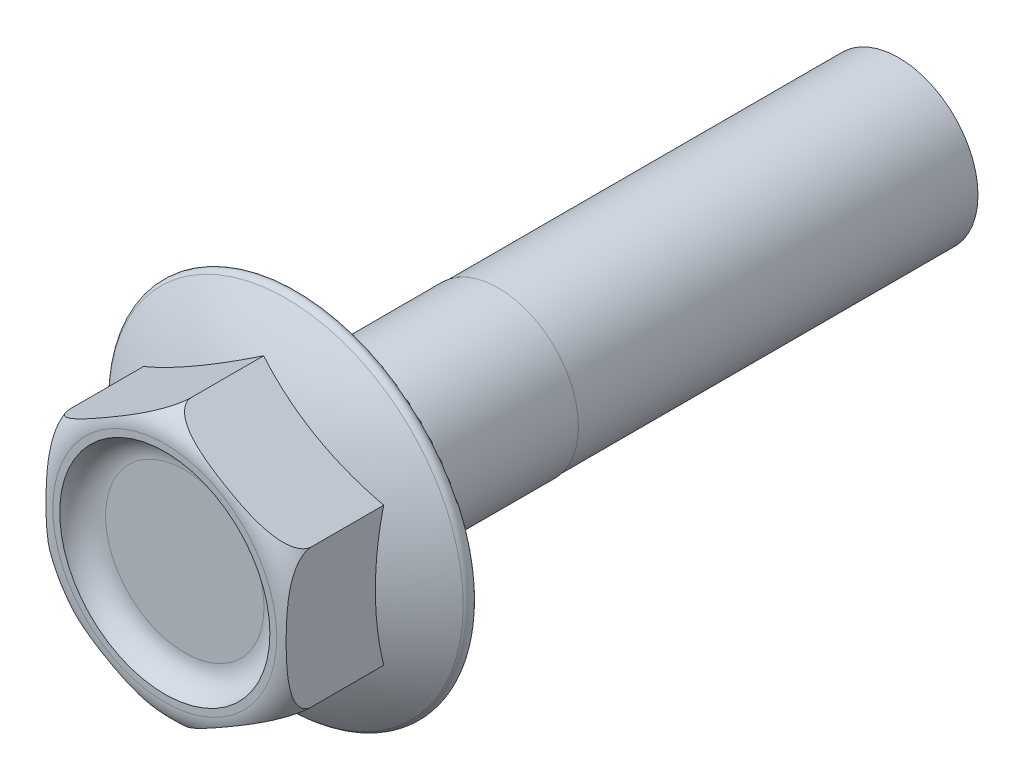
ISO-10303-21;
HEADER;
FILE_DESCRIPTION(('STEP AP214'),'2;1');
FILE_NAME('part.step','',(''),(''),'','','');
FILE_SCHEMA(('AUTOMOTIVE_DESIGN { 1 0 10303 214 1 1 1 1 }'));
ENDSEC;
DATA;
#1=APPLICATION_CONTEXT('core data for automotive mechanical design processes');
#2=APPLICATION_PROTOCOL_DEFINITION('international standard','automotive_design',2000,#1);
#3=PRODUCT_CONTEXT('',#1,'mechanical');
#4=PRODUCT('Part','Part','',(#3));
#5=PRODUCT_RELATED_PRODUCT_CATEGORY('part','',(#4));
#6=PRODUCT_DEFINITION_FORMATION('','',#4);
#7=PRODUCT_DEFINITION_CONTEXT('part definition',#1,'design');
#8=PRODUCT_DEFINITION('design','',#6,#7);
#9=PRODUCT_DEFINITION_SHAPE('','',#8);
#10=(LENGTH_UNIT() NAMED_UNIT(*) SI_UNIT(.MILLI.,.METRE.));
#11=(NAMED_UNIT(*) PLANE_ANGLE_UNIT() SI_UNIT($,.RADIAN.));
#12=(NAMED_UNIT(*) SI_UNIT($,.STERADIAN.) SOLID_ANGLE_UNIT());
#13=UNCERTAINTY_MEASURE_WITH_UNIT(LENGTH_MEASURE(1.E-05),#10,'distance_accuracy_value','');
#14=(GEOMETRIC_REPRESENTATION_CONTEXT(3) GLOBAL_UNCERTAINTY_ASSIGNED_CONTEXT((#13)) GLOBAL_UNIT_ASSIGNED_CONTEXT((#10,
#11,#12)) REPRESENTATION_CONTEXT('',''));
#15=CARTESIAN_POINT('',(0.,0.,0.));
#16=DIRECTION('',(0.,0.,1.));
#17=DIRECTION('',(1.,0.,0.));
#18=AXIS2_PLACEMENT_3D('',#15,#16,#17);
#19=CARTESIAN_POINT('',(0.,0.,-45.));
#20=DIRECTION('',(0.,0.,1.));
#21=DIRECTION('',(1.,0.,0.));
#22=AXIS2_PLACEMENT_3D('',#19,#20,#21);
#23=CYLINDRICAL_SURFACE('',#22,6.);
#24=CARTESIAN_POINT('',(0.,0.,-0.5));
#25=DIRECTION('',(0.,0.,-1.));
#26=DIRECTION('',(-1.,0.,0.));
#27=AXIS2_PLACEMENT_3D('',#24,#25,#26);
#28=CIRCLE('',#27,6.);
#29=CARTESIAN_POINT('',(6.,0.,-0.499999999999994));
#30=VERTEX_POINT('',#29);
#31=EDGE_CURVE('E42',#30,#30,#28,.T.);
#32=CARTESIAN_POINT('',(0.,0.,-15.));
#33=DIRECTION('',(0.,0.,1.));
#34=DIRECTION('',(1.,0.,0.));
#35=AXIS2_PLACEMENT_3D('',#32,#33,#34);
#36=CIRCLE('',#35,6.);
#37=CARTESIAN_POINT('',(6.,0.,-15.));
#38=VERTEX_POINT('',#37);
#39=EDGE_CURVE('E248',#38,#38,#36,.T.);
#40=CARTESIAN_POINT('',(6.,0.,-0.499999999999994));
#41=CARTESIAN_POINT('',(6.,0.,-0.65104166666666));
#42=CARTESIAN_POINT('',(6.,0.,-0.802083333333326));
#43=CARTESIAN_POINT('',(6.,0.,-1.10416666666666));
#44=CARTESIAN_POINT('',(6.,0.,-1.25520833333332));
#45=CARTESIAN_POINT('',(6.,0.,-1.55729166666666));
#46=CARTESIAN_POINT('',(6.,0.,-1.70833333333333));
#47=CARTESIAN_POINT('',(6.,0.,-2.01041666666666));
#48=CARTESIAN_POINT('',(6.,0.,-2.16145833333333));
#49=CARTESIAN_POINT('',(6.,0.,-2.46354166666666));
#50=CARTESIAN_POINT('',(6.,0.,-2.61458333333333));
#51=CARTESIAN_POINT('',(6.,0.,-2.91666666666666));
#52=CARTESIAN_POINT('',(6.,0.,-3.06770833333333));
#53=CARTESIAN_POINT('',(6.,0.,-3.36979166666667));
#54=CARTESIAN_POINT('',(6.,0.,-3.52083333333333));
#55=CARTESIAN_POINT('',(6.,0.,-3.82291666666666));
#56=CARTESIAN_POINT('',(6.,0.,-3.97395833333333));
#57=CARTESIAN_POINT('',(6.,0.,-4.27604166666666));
#58=CARTESIAN_POINT('',(6.,0.,-4.42708333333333));
#59=CARTESIAN_POINT('',(6.,0.,-4.72916666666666));
#60=CARTESIAN_POINT('',(6.,0.,-4.88020833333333));
#61=CARTESIAN_POINT('',(6.,0.,-5.18229166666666));
#62=CARTESIAN_POINT('',(6.,0.,-5.33333333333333));
#63=CARTESIAN_POINT('',(6.,0.,-5.63541666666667));
#64=CARTESIAN_POINT('',(6.,0.,-5.78645833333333));
#65=CARTESIAN_POINT('',(6.,0.,-6.08854166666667));
#66=CARTESIAN_POINT('',(6.,0.,-6.23958333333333));
#67=CARTESIAN_POINT('',(6.,0.,-6.54166666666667));
#68=CARTESIAN_POINT('',(6.,0.,-6.69270833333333));
#69=CARTESIAN_POINT('',(6.,0.,-6.99479166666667));
#70=CARTESIAN_POINT('',(6.,0.,-7.14583333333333));
#71=CARTESIAN_POINT('',(6.,0.,-7.44791666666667));
#72=CARTESIAN_POINT('',(6.,0.,-7.59895833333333));
#73=CARTESIAN_POINT('',(6.,0.,-7.90104166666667));
#74=CARTESIAN_POINT('',(6.,0.,-8.05208333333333));
#75=CARTESIAN_POINT('',(6.,0.,-8.35416666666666));
#76=CARTESIAN_POINT('',(6.,0.,-8.50520833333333));
#77=CARTESIAN_POINT('',(6.,0.,-8.80729166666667));
#78=CARTESIAN_POINT('',(6.,0.,-8.95833333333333));
#79=CARTESIAN_POINT('',(6.,0.,-9.26041666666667));
#80=CARTESIAN_POINT('',(6.,0.,-9.41145833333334));
#81=CARTESIAN_POINT('',(6.,0.,-9.71354166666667));
#82=CARTESIAN_POINT('',(6.,0.,-9.86458333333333));
#83=CARTESIAN_POINT('',(6.,0.,-10.1666666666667));
#84=CARTESIAN_POINT('',(6.,0.,-10.3177083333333));
#85=CARTESIAN_POINT('',(6.,0.,-10.6197916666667));
#86=CARTESIAN_POINT('',(6.,0.,-10.7708333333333));
#87=CARTESIAN_POINT('',(6.,0.,-11.0729166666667));
#88=CARTESIAN_POINT('',(6.,0.,-11.2239583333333));
#89=CARTESIAN_POINT('',(6.,0.,-11.5260416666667));
#90=CARTESIAN_POINT('',(6.,0.,-11.6770833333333));
#91=CARTESIAN_POINT('',(6.,0.,-11.9791666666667));
#92=CARTESIAN_POINT('',(6.,0.,-12.1302083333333));
#93=CARTESIAN_POINT('',(6.,0.,-12.4322916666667));
#94=CARTESIAN_POINT('',(6.,0.,-12.5833333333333));
#95=CARTESIAN_POINT('',(6.,0.,-12.8854166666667));
#96=CARTESIAN_POINT('',(6.,0.,-13.0364583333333));
#97=CARTESIAN_POINT('',(6.,0.,-13.3385416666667));
#98=CARTESIAN_POINT('',(6.,0.,-13.4895833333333));
#99=CARTESIAN_POINT('',(6.,0.,-13.7916666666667));
#100=CARTESIAN_POINT('',(6.,0.,-13.9427083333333));
#101=CARTESIAN_POINT('',(6.,0.,-14.2447916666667));
#102=CARTESIAN_POINT('',(6.,0.,-14.3958333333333));
#103=CARTESIAN_POINT('',(6.,0.,-14.6979166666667));
#104=CARTESIAN_POINT('',(6.,0.,-14.8489583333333));
#105=CARTESIAN_POINT('',(6.,0.,-15.));
#106=B_SPLINE_CURVE_WITH_KNOTS('',3,(#40,#41,#42,#43,#44,#45,#46,#47,#48,#49,#50,#51,#52,#53,
#54,#55,#56,#57,#58,#59,#60,#61,#62,#63,#64,#65,#66,#67,#68,#69,#70,#71,#72,#73,#74,#75,#76,#77,
#78,#79,#80,#81,#82,#83,#84,#85,#86,#87,#88,#89,#90,#91,#92,#93,#94,#95,#96,#97,#98,#99,#100,
#101,#102,#103,#104,#105),.UNSPECIFIED.,.F.,.F.,(4,2,2,2,2,2,2,2,2,2,2,2,2,2,2,2,2,2,2,2,2,2,2,
2,2,2,2,2,2,2,2,2,4),(0.,0.453124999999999,0.906249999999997,1.359375,1.8125,2.265625,
2.71875000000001,3.171875,3.625,4.078125,4.53125,4.98437500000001,5.4375,5.890625,
6.34375000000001,6.79687500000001,7.25000000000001,7.70312500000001,8.15625,8.60937500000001,
9.06250000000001,9.51562500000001,9.96875000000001,10.421875,10.875,11.328125,11.78125,
12.234375,12.6875,13.140625,13.59375,14.046875,14.5),.UNSPECIFIED.);
#107=EDGE_CURVE('BSEAM34',#30,#38,#106,.T.);
#108=ORIENTED_EDGE('',*,*,#31,.T.);
#109=ORIENTED_EDGE('',*,*,#39,.T.);
#110=ORIENTED_EDGE('',*,*,#107,.T.);
#111=ORIENTED_EDGE('',*,*,#107,.F.);
#112=EDGE_LOOP('',(#108,#110,#109,#111));
#113=FACE_BOUND('',#112,.T.);
#114=ADVANCED_FACE('F34',(#113),#23,.T.);
#115=CARTESIAN_POINT('',(0.,10.3923048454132,10.));
#116=DIRECTION('',(0.500000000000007,0.866025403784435,0.));
#117=DIRECTION('',(-0.866025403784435,0.500000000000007,0.));
#118=AXIS2_PLACEMENT_3D('',#115,#116,#117);
#119=PLANE('',#118);
#120=DIRECTION('',(0.,0.,-1.));
#121=VECTOR('',#120,1.);
#122=CARTESIAN_POINT('',(0.,10.3923048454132,10.));
#123=LINE('',#122,#121);
#124=CARTESIAN_POINT('',(0.,10.3923048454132,8.));
#125=VERTEX_POINT('',#124);
#126=CARTESIAN_POINT('',(0.,10.3923048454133,2.59151773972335));
#127=VERTEX_POINT('',#126);
#128=EDGE_CURVE('E56',#125,#127,#123,.T.);
#129=ORIENTED_EDGE('',*,*,#128,.F.);
#130=CARTESIAN_POINT('',(1.73205121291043E-08,10.3923048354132,7.9998));
#131=CARTESIAN_POINT('',(-1.00317260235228E-05,10.392310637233,8.02958397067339));
#132=CARTESIAN_POINT('',(0.00114301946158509,10.3916449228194,8.05935193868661));
#133=CARTESIAN_POINT('',(0.00572095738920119,10.3890018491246,8.11863286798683));
#134=CARTESIAN_POINT('',(0.00914419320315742,10.3870254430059,8.14814599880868));
#135=CARTESIAN_POINT('',(0.0226603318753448,10.3792218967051,8.23551712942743));
#136=CARTESIAN_POINT('',(0.0360017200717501,10.3715192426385,8.29273915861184));
#137=CARTESIAN_POINT('',(0.070317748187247,10.3517068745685,8.40378949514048));
#138=CARTESIAN_POINT('',(0.0912725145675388,10.3396086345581,8.45762621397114));
#139=CARTESIAN_POINT('',(0.139567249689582,10.3117256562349,8.56142342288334));
#140=CARTESIAN_POINT('',(0.166921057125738,10.2959329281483,8.61137519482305));
#141=CARTESIAN_POINT('',(0.245114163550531,10.2507881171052,8.73638292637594));
#142=CARTESIAN_POINT('',(0.300058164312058,10.2190661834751,8.80801007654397));
#143=CARTESIAN_POINT('',(0.418908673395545,10.1504478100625,8.94051938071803));
#144=CARTESIAN_POINT('',(0.482837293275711,10.1135386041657,9.00137416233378));
#145=CARTESIAN_POINT('',(0.606290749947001,10.0422627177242,9.10482458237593));
#146=CARTESIAN_POINT('',(0.664972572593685,10.0083827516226,9.14878872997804));
#147=CARTESIAN_POINT('',(0.785429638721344,9.93883683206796,9.23071355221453));
#148=CARTESIAN_POINT('',(0.84720721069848,9.90316953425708,9.26866961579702));
#149=CARTESIAN_POINT('',(0.973069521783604,9.83050289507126,9.33937435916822));
#150=CARTESIAN_POINT('',(1.03715815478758,9.79350130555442,9.37211369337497));
#151=CARTESIAN_POINT('',(1.16691522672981,9.71858602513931,9.43298121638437));
#152=CARTESIAN_POINT('',(1.2325831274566,9.68067264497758,9.46111095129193));
#153=CARTESIAN_POINT('',(1.39324252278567,9.5879158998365,9.52448288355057));
#154=CARTESIAN_POINT('',(1.48884009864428,9.53272261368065,9.55766999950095));
#155=CARTESIAN_POINT('',(1.68159690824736,9.42143441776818,9.61740739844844));
#156=CARTESIAN_POINT('',(1.77875693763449,9.36533904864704,9.64395417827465));
#157=CARTESIAN_POINT('',(1.97424367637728,9.25247472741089,9.69161777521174));
#158=CARTESIAN_POINT('',(2.07257220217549,9.19570472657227,9.71272452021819));
#159=CARTESIAN_POINT('',(2.26988444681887,9.08178644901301,9.75042301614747));
#160=CARTESIAN_POINT('',(2.36886828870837,9.02463810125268,9.76701389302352));
#161=CARTESIAN_POINT('',(2.56771567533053,8.90983350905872,9.79654822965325));
#162=CARTESIAN_POINT('',(2.66758116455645,8.85217614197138,9.8094739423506));
#163=CARTESIAN_POINT('',(2.8675793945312,8.73670711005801,9.83224088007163));
#164=CARTESIAN_POINT('',(2.96771215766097,8.67889543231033,9.84208183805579));
#165=CARTESIAN_POINT('',(3.16802966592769,8.56324206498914,9.85921028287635));
#166=CARTESIAN_POINT('',(3.26821423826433,8.50540047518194,9.86650051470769));
#167=CARTESIAN_POINT('',(3.46868291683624,8.38965982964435,9.87896707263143));
#168=CARTESIAN_POINT('',(3.56896702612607,8.33176077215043,9.88414333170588));
#169=CARTESIAN_POINT('',(3.81497011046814,8.18973082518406,9.89464750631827));
#170=CARTESIAN_POINT('',(3.96072065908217,8.10558170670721,9.89898478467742));
#171=CARTESIAN_POINT('',(4.25226434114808,7.93725888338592,9.90451006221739));
#172=CARTESIAN_POINT('',(4.39805747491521,7.85308517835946,9.90569803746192));
#173=CARTESIAN_POINT('',(4.68909952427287,7.68505197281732,9.9050948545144));
#174=CARTESIAN_POINT('',(4.83434845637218,7.60119246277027,9.90331470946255));
#175=CARTESIAN_POINT('',(5.12478399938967,7.43350942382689,9.89654386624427));
#176=CARTESIAN_POINT('',(5.26997061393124,7.34968589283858,9.89155339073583));
#177=CARTESIAN_POINT('',(5.51573105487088,7.20779603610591,9.87979435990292));
#178=CARTESIAN_POINT('',(5.61634100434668,7.14970885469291,9.87403944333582));
#179=CARTESIAN_POINT('',(5.81744497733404,7.03360142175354,9.86029006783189));
#180=CARTESIAN_POINT('',(5.91793900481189,6.97558116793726,9.85229568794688));
#181=CARTESIAN_POINT('',(6.11904523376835,6.85947243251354,9.83357860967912));
#182=CARTESIAN_POINT('',(6.21965687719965,6.80138427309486,9.82284775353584));
#183=CARTESIAN_POINT('',(6.42057050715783,6.68538673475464,9.79808380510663));
#184=CARTESIAN_POINT('',(6.52087251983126,6.62747734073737,9.78405099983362));
#185=CARTESIAN_POINT('',(6.73567393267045,6.50346168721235,9.74961340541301));
#186=CARTESIAN_POINT('',(6.85009918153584,6.43739823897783,9.72857609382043));
#187=CARTESIAN_POINT('',(7.07795669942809,6.30584463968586,9.67986704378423));
#188=CARTESIAN_POINT('',(7.19138856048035,6.24035472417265,9.65219270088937));
#189=CARTESIAN_POINT('',(7.41605382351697,6.1106441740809,9.58865754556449));
#190=CARTESIAN_POINT('',(7.52729439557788,6.04641939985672,9.55283118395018));
#191=CARTESIAN_POINT('',(7.74684058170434,5.91966435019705,9.47085684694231));
#192=CARTESIAN_POINT('',(7.855149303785,5.8571322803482,9.4247203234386));
#193=CARTESIAN_POINT('',(8.0400249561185,5.75039427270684,9.33283349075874));
#194=CARTESIAN_POINT('',(8.11765806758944,5.70557277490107,9.28997012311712));
#195=CARTESIAN_POINT('',(8.26906961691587,5.61815527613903,9.19557647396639));
#196=CARTESIAN_POINT('',(8.3428431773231,5.57556209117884,9.14403555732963));
#197=CARTESIAN_POINT('',(8.48507848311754,5.49344249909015,9.0302819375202));
#198=CARTESIAN_POINT('',(8.55348390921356,5.45394860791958,8.96797366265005));
#199=CARTESIAN_POINT('',(8.68087972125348,5.3803966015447,8.83153313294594));
#200=CARTESIAN_POINT('',(8.73989105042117,5.3463263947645,8.75742793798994));
#201=CARTESIAN_POINT('',(8.8256756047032,5.29679865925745,8.62463875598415));
#202=CARTESIAN_POINT('',(8.85653794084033,5.27898028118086,8.56949341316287));
#203=CARTESIAN_POINT('',(8.91036675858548,5.24790219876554,8.45439041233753));
#204=CARTESIAN_POINT('',(8.93335610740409,5.23462929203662,8.39444732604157));
#205=CARTESIAN_POINT('',(8.96725843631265,5.21505577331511,8.27930975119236));
#206=CARTESIAN_POINT('',(8.97940252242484,5.20804438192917,8.22460642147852));
#207=CARTESIAN_POINT('',(8.99169441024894,5.20094765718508,8.14120337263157));
#208=CARTESIAN_POINT('',(8.99480473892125,5.19915190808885,8.11305826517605));
#209=CARTESIAN_POINT('',(8.99896286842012,5.19675121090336,8.05654649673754));
#210=CARTESIAN_POINT('',(9.00000923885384,5.19614708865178,8.02817969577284));
#211=CARTESIAN_POINT('',(8.99999998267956,5.19615243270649,7.9998));
#212=B_SPLINE_CURVE_WITH_KNOTS('',3,(#130,#131,#132,#133,#134,#135,#136,#137,#138,#139,#140,
#141,#142,#143,#144,#145,#146,#147,#148,#149,#150,#151,#152,#153,#154,#155,#156,#157,#158,#159,
#160,#161,#162,#163,#164,#165,#166,#167,#168,#169,#170,#171,#172,#173,#174,#175,#176,#177,#178,
#179,#180,#181,#182,#183,#184,#185,#186,#187,#188,#189,#190,#191,#192,#193,#194,#195,#196,#197,
#198,#199,#200,#201,#202,#203,#204,#205,#206,#207,#208,#209,#210,#211),.UNSPECIFIED.,.F.,.F.,(4,
2,2,2,2,2,2,2,2,2,2,2,2,2,2,2,2,2,2,2,2,2,2,2,2,2,2,2,2,2,2,2,2,2,2,2,2,2,2,2,4),(0.,
0.0892911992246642,0.178517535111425,0.355395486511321,0.531815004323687,0.708619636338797,
0.994036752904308,1.28016901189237,1.52214221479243,1.76430023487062,2.00688730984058,
2.24939285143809,2.59491912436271,2.94062730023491,3.28697102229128,3.63338173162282,
3.98144221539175,4.3295328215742,4.67724766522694,5.02497353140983,5.52999857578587,
6.03502745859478,6.53818661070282,7.04131086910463,7.39024410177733,7.7391650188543,
8.08913852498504,8.43908162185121,8.84032273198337,9.24172155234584,9.64145455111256,
10.0407457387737,10.3384699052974,10.6365616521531,10.9374496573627,11.2376571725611,
11.4339694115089,11.6297065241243,11.7983506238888,11.8833800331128,11.9684683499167),.UNSPECIFIED.);
#213=CARTESIAN_POINT('',(8.99999999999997,5.19615242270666,8.));
#214=VERTEX_POINT('',#213);
#215=EDGE_CURVE('E49',#125,#214,#212,.T.);
#216=ORIENTED_EDGE('',*,*,#215,.T.);
#217=DIRECTION('',(0.,0.,-1.));
#218=VECTOR('',#217,1.);
#219=CARTESIAN_POINT('',(8.99999999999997,5.19615242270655,10.));
#220=LINE('',#219,#218);
#221=CARTESIAN_POINT('',(8.99999999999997,5.19615242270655,2.59151773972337));
#222=VERTEX_POINT('',#221);
#223=EDGE_CURVE('E98',#214,#222,#220,.T.);
#224=ORIENTED_EDGE('',*,*,#223,.T.);
#225=CARTESIAN_POINT('',(4.50000000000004,7.79422863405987,-18.625));
#226=DIRECTION('',(0.500000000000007,0.866025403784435,0.));
#227=DIRECTION('',(-0.866025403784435,0.500000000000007,0.));
#228=AXIS2_PLACEMENT_3D('',#225,#226,#227);
#229=CIRCLE('',#228,21.8435488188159);
#230=EDGE_CURVE('E114',#222,#127,#229,.F.);
#231=ORIENTED_EDGE('',*,*,#230,.T.);
#232=EDGE_LOOP('',(#129,#216,#224,#231));
#233=FACE_BOUND('',#232,.T.);
#234=ADVANCED_FACE('F96',(#233),#119,.T.);
#235=CARTESIAN_POINT('',(8.99999999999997,5.19615242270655,10.));
#236=DIRECTION('',(1.,0.,0.));
#237=DIRECTION('',(0.,1.,0.));
#238=AXIS2_PLACEMENT_3D('',#235,#236,#237);
#239=PLANE('',#238);
#240=ORIENTED_EDGE('',*,*,#223,.F.);
#241=CARTESIAN_POINT('',(8.99999999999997,0.,9.90544131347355));
#242=CARTESIAN_POINT('',(8.99999999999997,-0.140608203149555,9.90544145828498));
#243=CARTESIAN_POINT('',(8.99999999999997,-0.281216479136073,9.90439921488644));
#244=CARTESIAN_POINT('',(8.99999999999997,-0.562403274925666,9.90012540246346));
#245=CARTESIAN_POINT('',(8.99999999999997,-0.702981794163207,9.89689379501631));
#246=CARTESIAN_POINT('',(8.99999999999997,-0.984230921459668,9.88791903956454));
#247=CARTESIAN_POINT('',(8.99999999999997,-1.12490143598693,9.88217286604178));
#248=CARTESIAN_POINT('',(8.99999999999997,-1.406084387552,9.86763420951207));
#249=CARTESIAN_POINT('',(8.99999999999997,-1.5465968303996,9.85884184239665));
#250=CARTESIAN_POINT('',(8.99999999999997,-1.82634513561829,9.83752453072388));
#251=CARTESIAN_POINT('',(8.99999999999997,-1.96558299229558,9.82502645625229));
#252=CARTESIAN_POINT('',(8.99999999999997,-2.24359013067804,9.79528523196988));
#253=CARTESIAN_POINT('',(8.99999999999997,-2.38235932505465,9.77804124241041));
#254=CARTESIAN_POINT('',(8.99999999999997,-2.65875921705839,9.73758327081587));
#255=CARTESIAN_POINT('',(8.99999999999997,-2.79639163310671,9.71438126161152));
#256=CARTESIAN_POINT('',(8.99999999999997,-3.07014187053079,9.66040982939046));
#257=CARTESIAN_POINT('',(8.99999999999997,-3.20626044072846,9.62964433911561));
#258=CARTESIAN_POINT('',(8.99999999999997,-3.42398158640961,9.5722249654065));
#259=CARTESIAN_POINT('',(8.99999999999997,-3.50637088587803,9.5485583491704));
#260=CARTESIAN_POINT('',(8.99999999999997,-3.66986049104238,9.49700825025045));
#261=CARTESIAN_POINT('',(8.99999999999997,-3.75096041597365,9.46912354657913));
#262=CARTESIAN_POINT('',(8.99999999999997,-3.91126101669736,9.40850332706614));
#263=CARTESIAN_POINT('',(8.99999999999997,-3.99046338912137,9.3757723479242));
#264=CARTESIAN_POINT('',(8.99999999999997,-4.14627374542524,9.30468083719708));
#265=CARTESIAN_POINT('',(8.99999999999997,-4.22288303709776,9.26632319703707));
#266=CARTESIAN_POINT('',(8.99999999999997,-4.38942397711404,9.17367759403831));
#267=CARTESIAN_POINT('',(8.99999999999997,-4.47846106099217,9.11774804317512));
#268=CARTESIAN_POINT('',(8.99999999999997,-4.64819677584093,8.99427497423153));
#269=CARTESIAN_POINT('',(8.99999999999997,-4.72890519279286,8.92674534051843));
#270=CARTESIAN_POINT('',(8.99999999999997,-4.85705517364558,8.79871503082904));
#271=CARTESIAN_POINT('',(8.99999999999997,-4.90756792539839,8.741316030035));
#272=CARTESIAN_POINT('',(8.99999999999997,-4.99906134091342,8.61933067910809));
#273=CARTESIAN_POINT('',(8.99999999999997,-5.04005722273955,8.55475605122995));
#274=CARTESIAN_POINT('',(8.99999999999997,-5.10234887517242,8.43287012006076));
#275=CARTESIAN_POINT('',(8.99999999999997,-5.12595480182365,8.3767481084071));
#276=CARTESIAN_POINT('',(8.99999999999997,-5.16352069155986,8.2613456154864));
#277=CARTESIAN_POINT('',(8.99999999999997,-5.17748795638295,8.2020675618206));
#278=CARTESIAN_POINT('',(8.99999999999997,-5.19465202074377,8.08165642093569));
#279=CARTESIAN_POINT('',(8.99999999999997,-5.19779760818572,8.02051589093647));
#280=CARTESIAN_POINT('',(8.99999999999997,-5.19287502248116,7.89868925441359));
#281=CARTESIAN_POINT('',(8.99999999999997,-5.1848059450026,7.83800318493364));
#282=CARTESIAN_POINT('',(8.99999999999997,-5.15913986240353,7.72321167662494));
#283=CARTESIAN_POINT('',(8.99999999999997,-5.1422525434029,7.66894353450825));
#284=CARTESIAN_POINT('',(8.99999999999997,-5.10059810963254,7.56355577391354));
#285=CARTESIAN_POINT('',(8.99999999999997,-5.07582835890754,7.51243721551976));
#286=CARTESIAN_POINT('',(8.99999999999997,-5.00657631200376,7.39085822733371));
#287=CARTESIAN_POINT('',(8.99999999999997,-4.95829629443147,7.32256309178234));
#288=CARTESIAN_POINT('',(8.99999999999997,-4.85150523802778,7.19450071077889));
#289=CARTESIAN_POINT('',(8.99999999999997,-4.79296815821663,7.13475589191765));
#290=CARTESIAN_POINT('',(8.99999999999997,-4.63226371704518,6.99059910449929));
#291=CARTESIAN_POINT('',(8.99999999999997,-4.52465801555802,6.91229839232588));
#292=CARTESIAN_POINT('',(8.99999999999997,-4.29924123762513,6.7724848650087));
#293=CARTESIAN_POINT('',(8.99999999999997,-4.18141109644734,6.71100433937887));
#294=CARTESIAN_POINT('',(8.99999999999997,-3.94138961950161,6.60220171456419));
#295=CARTESIAN_POINT('',(8.99999999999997,-3.81927677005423,6.55470278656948));
#296=CARTESIAN_POINT('',(8.99999999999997,-3.5714437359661,6.47010820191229));
#297=CARTESIAN_POINT('',(8.99999999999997,-3.44571987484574,6.43302359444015));
#298=CARTESIAN_POINT('',(8.99999999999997,-3.19171844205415,6.36710030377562));
#299=CARTESIAN_POINT('',(8.99999999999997,-3.06343367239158,6.33828992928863));
#300=CARTESIAN_POINT('',(8.99999999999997,-2.80562948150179,6.28741795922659));
#301=CARTESIAN_POINT('',(8.99999999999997,-2.67611070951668,6.26535299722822));
#302=CARTESIAN_POINT('',(8.99999999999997,-2.37302847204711,6.22014655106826));
#303=CARTESIAN_POINT('',(8.99999999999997,-2.19915844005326,6.1990927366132));
#304=CARTESIAN_POINT('',(8.99999999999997,-1.85068824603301,6.16406973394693));
#305=CARTESIAN_POINT('',(8.99999999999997,-1.67608787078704,6.15010278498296));
#306=CARTESIAN_POINT('',(8.99999999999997,-1.32630916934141,6.12746617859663));
#307=CARTESIAN_POINT('',(8.99999999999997,-1.15113037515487,6.11880403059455));
#308=CARTESIAN_POINT('',(8.99999999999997,-0.800647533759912,6.1055865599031));
#309=CARTESIAN_POINT('',(8.99999999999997,-0.625343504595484,6.10103073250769));
#310=CARTESIAN_POINT('',(8.99999999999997,-0.274453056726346,6.09532791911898));
#311=CARTESIAN_POINT('',(8.99999999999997,-0.0988665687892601,6.0941854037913));
#312=CARTESIAN_POINT('',(8.99999999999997,0.252308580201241,6.09514060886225));
#313=CARTESIAN_POINT('',(8.99999999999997,0.427897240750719,6.09723852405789));
#314=CARTESIAN_POINT('',(8.99999999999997,0.778814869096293,6.10500131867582));
#315=CARTESIAN_POINT('',(8.99999999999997,0.954143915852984,6.11066244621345));
#316=CARTESIAN_POINT('',(8.99999999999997,1.30459548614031,6.12639256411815));
#317=CARTESIAN_POINT('',(8.99999999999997,1.47971802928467,6.13646109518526));
#318=CARTESIAN_POINT('',(8.99999999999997,1.8294323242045,6.16237938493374));
#319=CARTESIAN_POINT('',(8.99999999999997,2.00402435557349,6.17822521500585));
#320=CARTESIAN_POINT('',(8.99999999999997,2.35247295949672,6.21768236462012));
#321=CARTESIAN_POINT('',(8.99999999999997,2.52632903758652,6.24129825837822));
#322=CARTESIAN_POINT('',(8.99999999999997,2.87196312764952,6.29891286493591));
#323=CARTESIAN_POINT('',(8.99999999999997,3.04374489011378,6.33288845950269));
#324=CARTESIAN_POINT('',(8.99999999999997,3.38391809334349,6.41478716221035));
#325=CARTESIAN_POINT('',(8.99999999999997,3.55231354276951,6.46269259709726));
#326=CARTESIAN_POINT('',(8.99999999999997,3.80108212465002,6.5490346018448));
#327=CARTESIAN_POINT('',(8.99999999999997,3.88388071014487,6.5804760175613));
#328=CARTESIAN_POINT('',(8.99999999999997,4.04708941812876,6.64900306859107));
#329=CARTESIAN_POINT('',(8.99999999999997,4.12750081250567,6.68608563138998));
#330=CARTESIAN_POINT('',(8.99999999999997,4.28463307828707,6.76664524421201));
#331=CARTESIAN_POINT('',(8.99999999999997,4.36136902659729,6.81009254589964));
#332=CARTESIAN_POINT('',(8.99999999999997,4.51002023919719,6.90449207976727));
#333=CARTESIAN_POINT('',(8.99999999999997,4.58194192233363,6.95543401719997));
#334=CARTESIAN_POINT('',(8.99999999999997,4.70876350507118,7.05772106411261));
#335=CARTESIAN_POINT('',(8.99999999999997,4.76460586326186,7.10788564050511));
#336=CARTESIAN_POINT('',(8.99999999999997,4.86948462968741,7.21505318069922));
#337=CARTESIAN_POINT('',(8.99999999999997,4.91851701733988,7.27206014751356));
#338=CARTESIAN_POINT('',(8.99999999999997,5.007743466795,7.39377058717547));
#339=CARTESIAN_POINT('',(8.99999999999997,5.04782810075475,7.45855586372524));
#340=CARTESIAN_POINT('',(8.99999999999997,5.11515542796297,7.59448910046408));
#341=CARTESIAN_POINT('',(8.99999999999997,5.14242822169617,7.66562167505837));
#342=CARTESIAN_POINT('',(8.99999999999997,5.1764401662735,7.7940531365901));
#343=CARTESIAN_POINT('',(8.99999999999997,5.18657830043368,7.85045595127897));
#344=CARTESIAN_POINT('',(8.99999999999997,5.19712790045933,7.96416484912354));
#345=CARTESIAN_POINT('',(8.99999999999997,5.19754399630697,8.02147048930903));
#346=CARTESIAN_POINT('',(8.99999999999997,5.18861616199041,8.13525813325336));
#347=CARTESIAN_POINT('',(8.99999999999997,5.17927957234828,8.19174072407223));
#348=CARTESIAN_POINT('',(8.99999999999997,5.15159965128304,8.30244345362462));
#349=CARTESIAN_POINT('',(8.99999999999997,5.13325065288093,8.35666214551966));
#350=CARTESIAN_POINT('',(8.99999999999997,5.08225916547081,8.47711527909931));
#351=CARTESIAN_POINT('',(8.99999999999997,5.04700868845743,8.54224200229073));
#352=CARTESIAN_POINT('',(8.99999999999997,4.96643486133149,8.66591267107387));
#353=CARTESIAN_POINT('',(8.99999999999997,4.92109267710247,8.72444399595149));
#354=CARTESIAN_POINT('',(8.99999999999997,4.79905438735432,8.86169816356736));
#355=CARTESIAN_POINT('',(8.99999999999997,4.71784170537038,8.93637526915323));
#356=CARTESIAN_POINT('',(8.99999999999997,4.54509584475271,9.07250830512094));
#357=CARTESIAN_POINT('',(8.99999999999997,4.45354072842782,9.13393529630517));
#358=CARTESIAN_POINT('',(8.99999999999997,4.27297473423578,9.24027220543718));
#359=CARTESIAN_POINT('',(8.99999999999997,4.18454958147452,9.28619723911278));
#360=CARTESIAN_POINT('',(8.99999999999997,4.00405983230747,9.37033389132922));
#361=CARTESIAN_POINT('',(8.99999999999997,3.91199208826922,9.40853865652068));
#362=CARTESIAN_POINT('',(8.99999999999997,3.72527026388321,9.47848178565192));
#363=CARTESIAN_POINT('',(8.99999999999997,3.6306116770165,9.51020794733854));
#364=CARTESIAN_POINT('',(8.99999999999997,3.43968134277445,9.56812449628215));
#365=CARTESIAN_POINT('',(8.99999999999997,3.34341027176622,9.59431714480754));
#366=CARTESIAN_POINT('',(8.99999999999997,3.11496284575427,9.65062566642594));
#367=CARTESIAN_POINT('',(8.99999999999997,2.98230483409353,9.67877387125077));
#368=CARTESIAN_POINT('',(8.99999999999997,2.71570608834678,9.72826362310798));
#369=CARTESIAN_POINT('',(8.99999999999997,2.58176484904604,9.74960236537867));
#370=CARTESIAN_POINT('',(8.99999999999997,2.31292129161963,9.78688728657));
#371=CARTESIAN_POINT('',(8.99999999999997,2.1780177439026,9.80282442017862));
#372=CARTESIAN_POINT('',(8.99999999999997,1.90780012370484,9.83037175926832));
#373=CARTESIAN_POINT('',(8.99999999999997,1.77248611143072,9.84198257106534));
#374=CARTESIAN_POINT('',(8.99999999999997,1.50081715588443,9.86181316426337));
#375=CARTESIAN_POINT('',(8.99999999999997,1.36446076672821,9.87001262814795));
#376=CARTESIAN_POINT('',(8.99999999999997,1.09160779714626,9.88359584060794));
#377=CARTESIAN_POINT('',(8.99999999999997,0.955111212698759,9.88897950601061));
#378=CARTESIAN_POINT('',(8.99999999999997,0.682192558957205,9.89739967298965));
#379=CARTESIAN_POINT('',(8.99999999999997,0.545770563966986,9.90043865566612));
#380=CARTESIAN_POINT('',(8.99999999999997,0.272899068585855,9.90445939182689));
#381=CARTESIAN_POINT('',(8.99999999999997,0.136449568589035,9.90544117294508));
#382=CARTESIAN_POINT('',(8.99999999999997,0.,9.90544131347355));
#383=B_SPLINE_CURVE_WITH_KNOTS('',3,(#241,#242,#243,#244,#245,#246,#247,#248,#249,#250,#251,
#252,#253,#254,#255,#256,#257,#258,#259,#260,#261,#262,#263,#264,#265,#266,#267,#268,#269,#270,
#271,#272,#273,#274,#275,#276,#277,#278,#279,#280,#281,#282,#283,#284,#285,#286,#287,#288,#289,
#290,#291,#292,#293,#294,#295,#296,#297,#298,#299,#300,#301,#302,#303,#304,#305,#306,#307,#308,
#309,#310,#311,#312,#313,#314,#315,#316,#317,#318,#319,#320,#321,#322,#323,#324,#325,#326,#327,
#328,#329,#330,#331,#332,#333,#334,#335,#336,#337,#338,#339,#340,#341,#342,#343,#344,#345,#346,
#347,#348,#349,#350,#351,#352,#353,#354,#355,#356,#357,#358,#359,#360,#361,#362,#363,#364,#365,
#366,#367,#368,#369,#370,#371,#372,#373,#374,#375,#376,#377,#378,#379,#380,#381,#382),
.UNSPECIFIED.,.T.,.F.,(4,2,2,2,2,2,2,2,2,2,2,2,2,2,2,2,2,2,2,2,2,2,2,2,2,2,2,2,2,2,2,2,2,2,2,2,
2,2,2,2,2,2,2,2,2,2,2,2,2,2,2,2,2,2,2,2,2,2,2,2,2,2,2,2,2,2,2,2,2,2,4),(0.,0.421820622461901,
0.843648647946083,1.26598561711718,1.68830652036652,2.10763709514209,2.52704191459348,
2.94561043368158,3.36396177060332,3.62103387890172,3.87818054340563,4.13508799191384,
4.39186388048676,4.70658086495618,5.02092375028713,5.24958108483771,5.47787022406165,
5.65978427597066,5.84156036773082,6.02419551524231,6.20684539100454,6.37665507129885,
6.54652159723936,6.79601122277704,7.04614368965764,7.44312954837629,7.8408722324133,
8.23334408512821,8.62623077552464,9.02044606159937,9.41446428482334,9.93967292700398,
10.4650474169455,10.991163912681,11.5172157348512,12.0439562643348,12.5707284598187,
13.0969469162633,13.6231105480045,14.1489170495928,14.6750336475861,15.1999846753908,
15.7242725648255,15.9898099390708,16.2552031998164,16.5193934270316,16.7832240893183,
17.0079221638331,17.2327523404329,17.4601974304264,17.6871054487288,17.8582531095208,
18.0293192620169,18.2002567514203,18.3713018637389,18.5922347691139,18.8135835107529,
19.1427121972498,19.4725526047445,19.7710328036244,20.0697768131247,20.3690784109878,
20.6682574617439,21.0748492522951,21.4816082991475,21.8890451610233,22.2964249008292,
22.7061973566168,23.1159819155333,23.525332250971,23.934677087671),.UNSPECIFIED.);
#384=CARTESIAN_POINT('',(8.99999999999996,-5.19615242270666,8.));
#385=VERTEX_POINT('',#384);
#386=EDGE_CURVE('E86',#214,#385,#383,.T.);
#387=ORIENTED_EDGE('',*,*,#386,.T.);
#388=DIRECTION('',(0.,0.,-1.));
#389=VECTOR('',#388,1.);
#390=CARTESIAN_POINT('',(8.99999999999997,-5.19615242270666,10.));
#391=LINE('',#390,#389);
#392=CARTESIAN_POINT('',(8.99999999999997,-5.19615242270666,2.59151773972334));
#393=VERTEX_POINT('',#392);
#394=EDGE_CURVE('E106',#385,#393,#391,.T.);
#395=ORIENTED_EDGE('',*,*,#394,.T.);
#396=CARTESIAN_POINT('',(8.99999999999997,0.,-18.625));
#397=DIRECTION('',(1.,0.,0.));
#398=DIRECTION('',(0.,1.,0.));
#399=AXIS2_PLACEMENT_3D('',#396,#397,#398);
#400=CIRCLE('',#399,21.8435488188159);
#401=EDGE_CURVE('E105',#393,#222,#400,.F.);
#402=ORIENTED_EDGE('',*,*,#401,.T.);
#403=EDGE_LOOP('',(#240,#387,#395,#402));
#404=FACE_BOUND('',#403,.T.);
#405=ADVANCED_FACE('F103',(#404),#239,.T.);
#406=CARTESIAN_POINT('',(8.99999999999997,-5.19615242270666,10.));
#407=DIRECTION('',(0.499999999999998,-0.86602540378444,0.));
#408=DIRECTION('',(0.86602540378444,0.499999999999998,0.));
#409=AXIS2_PLACEMENT_3D('',#406,#407,#408);
#410=PLANE('',#409);
#411=ORIENTED_EDGE('',*,*,#394,.F.);
#412=CARTESIAN_POINT('',(8.99999998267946,-5.19615243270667,7.9998));
#413=CARTESIAN_POINT('',(9.00001003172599,-5.19614663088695,8.02958397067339));
#414=CARTESIAN_POINT('',(8.99885698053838,-5.1968123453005,8.05935193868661));
#415=CARTESIAN_POINT('',(8.99427904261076,-5.19945541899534,8.11863286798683));
#416=CARTESIAN_POINT('',(8.99085580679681,-5.20143182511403,8.14814599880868));
#417=CARTESIAN_POINT('',(8.97733966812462,-5.20923537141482,8.23551712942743));
#418=CARTESIAN_POINT('',(8.96399827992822,-5.21693802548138,8.29273915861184));
#419=CARTESIAN_POINT('',(8.92968225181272,-5.23675039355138,8.40378949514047));
#420=CARTESIAN_POINT('',(8.90872748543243,-5.24884863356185,8.45762621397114));
#421=CARTESIAN_POINT('',(8.86043275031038,-5.276731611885,8.56142342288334));
#422=CARTESIAN_POINT('',(8.83307894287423,-5.29252433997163,8.61137519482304));
#423=CARTESIAN_POINT('',(8.75488583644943,-5.33766915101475,8.73638292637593));
#424=CARTESIAN_POINT('',(8.69994183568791,-5.36939108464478,8.80801007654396));
#425=CARTESIAN_POINT('',(8.58109132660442,-5.43800945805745,8.94051938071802));
#426=CARTESIAN_POINT('',(8.51716270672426,-5.47491866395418,9.00137416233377));
#427=CARTESIAN_POINT('',(8.39370925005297,-5.54619455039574,9.10482458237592));
#428=CARTESIAN_POINT('',(8.33502742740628,-5.58007451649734,9.14878872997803));
#429=CARTESIAN_POINT('',(8.21457036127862,-5.64962043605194,9.23071355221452));
#430=CARTESIAN_POINT('',(8.15279278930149,-5.68528773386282,9.26866961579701));
#431=CARTESIAN_POINT('',(8.02693047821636,-5.75795437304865,9.33937435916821));
#432=CARTESIAN_POINT('',(7.96284184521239,-5.79495596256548,9.37211369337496));
#433=CARTESIAN_POINT('',(7.83308477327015,-5.86987124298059,9.43298121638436));
#434=CARTESIAN_POINT('',(7.76741687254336,-5.90778462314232,9.46111095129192));
#435=CARTESIAN_POINT('',(7.60675747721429,-6.0005413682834,9.52448288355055));
#436=CARTESIAN_POINT('',(7.51115990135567,-6.05573465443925,9.55766999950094));
#437=CARTESIAN_POINT('',(7.3184030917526,-6.16702285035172,9.61740739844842));
#438=CARTESIAN_POINT('',(7.22124306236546,-6.22311821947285,9.64395417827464));
#439=CARTESIAN_POINT('',(7.02575632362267,-6.335982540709,9.69161777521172));
#440=CARTESIAN_POINT('',(6.92742779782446,-6.39275254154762,9.71272452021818));
#441=CARTESIAN_POINT('',(6.73011555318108,-6.50667081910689,9.75042301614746));
#442=CARTESIAN_POINT('',(6.63113171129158,-6.56381916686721,9.76701389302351));
#443=CARTESIAN_POINT('',(6.43228432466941,-6.67862375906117,9.79654822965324));
#444=CARTESIAN_POINT('',(6.33241883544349,-6.73628112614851,9.80947394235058));
#445=CARTESIAN_POINT('',(6.13242060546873,-6.85175015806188,9.83224088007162));
#446=CARTESIAN_POINT('',(6.03228784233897,-6.90956183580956,9.84208183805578));
#447=CARTESIAN_POINT('',(5.83197033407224,-7.02521520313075,9.85921028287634));
#448=CARTESIAN_POINT('',(5.73178576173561,-7.08305679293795,9.86650051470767));
#449=CARTESIAN_POINT('',(5.53131708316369,-7.19879743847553,9.87896707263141));
#450=CARTESIAN_POINT('',(5.43103297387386,-7.25669649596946,9.88414333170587));
#451=CARTESIAN_POINT('',(5.18502988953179,-7.39872644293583,9.89464750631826));
#452=CARTESIAN_POINT('',(5.03927934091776,-7.48287556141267,9.89898478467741));
#453=CARTESIAN_POINT('',(4.74773565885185,-7.65119838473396,9.90451006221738));
#454=CARTESIAN_POINT('',(4.60194252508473,-7.73537208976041,9.9056980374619));
#455=CARTESIAN_POINT('',(4.31090047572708,-7.90340529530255,9.90509485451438));
#456=CARTESIAN_POINT('',(4.16565154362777,-7.98726480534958,9.90331470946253));
#457=CARTESIAN_POINT('',(3.87521600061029,-8.15494784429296,9.89654386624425));
#458=CARTESIAN_POINT('',(3.73002938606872,-8.23877137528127,9.89155339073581));
#459=CARTESIAN_POINT('',(3.48426894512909,-8.38066123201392,9.8797943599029));
#460=CARTESIAN_POINT('',(3.38365899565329,-8.43874841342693,9.87403944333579));
#461=CARTESIAN_POINT('',(3.18255502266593,-8.55485584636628,9.86029006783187));
#462=CARTESIAN_POINT('',(3.08206099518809,-8.61287610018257,9.85229568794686));
#463=CARTESIAN_POINT('',(2.88095476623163,-8.72898483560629,9.83357860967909));
#464=CARTESIAN_POINT('',(2.78034312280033,-8.78707299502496,9.82284775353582));
#465=CARTESIAN_POINT('',(2.57942949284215,-8.90307053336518,9.7980838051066));
#466=CARTESIAN_POINT('',(2.47912748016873,-8.96097992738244,9.7840509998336));
#467=CARTESIAN_POINT('',(2.26432606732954,-9.08499558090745,9.74961340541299));
#468=CARTESIAN_POINT('',(2.14990081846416,-9.15105902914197,9.72857609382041));
#469=CARTESIAN_POINT('',(1.92204330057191,-9.28261262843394,9.67986704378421));
#470=CARTESIAN_POINT('',(1.80861143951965,-9.34810254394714,9.65219270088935));
#471=CARTESIAN_POINT('',(1.58394617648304,-9.47781309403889,9.58865754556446));
#472=CARTESIAN_POINT('',(1.47270560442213,-9.54203786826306,9.55283118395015));
#473=CARTESIAN_POINT('',(1.25315941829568,-9.66879291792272,9.47085684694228));
#474=CARTESIAN_POINT('',(1.14485069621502,-9.73132498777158,9.42472032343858));
#475=CARTESIAN_POINT('',(0.959975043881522,-9.83806299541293,9.33283349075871));
#476=CARTESIAN_POINT('',(0.882341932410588,-9.8828844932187,9.28997012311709));
#477=CARTESIAN_POINT('',(0.730930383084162,-9.97030199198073,9.19557647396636));
#478=CARTESIAN_POINT('',(0.65715682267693,-10.0128951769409,9.1440355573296));
#479=CARTESIAN_POINT('',(0.514921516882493,-10.0950147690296,9.03028193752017));
#480=CARTESIAN_POINT('',(0.446516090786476,-10.1345086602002,8.96797366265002));
#481=CARTESIAN_POINT('',(0.319120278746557,-10.2080606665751,8.83153313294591));
#482=CARTESIAN_POINT('',(0.260108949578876,-10.2421308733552,8.75742793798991));
#483=CARTESIAN_POINT('',(0.174324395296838,-10.2916586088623,8.62463875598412));
#484=CARTESIAN_POINT('',(0.143462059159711,-10.3094769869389,8.56949341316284));
#485=CARTESIAN_POINT('',(0.0896332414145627,-10.3405550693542,8.45439041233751));
#486=CARTESIAN_POINT('',(0.0666438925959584,-10.3538279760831,8.39444732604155));
#487=CARTESIAN_POINT('',(0.0327415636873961,-10.3734014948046,8.27930975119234));
#488=CARTESIAN_POINT('',(0.0205974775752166,-10.3804128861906,8.2246064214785));
#489=CARTESIAN_POINT('',(0.00830558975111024,-10.3875096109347,8.14120337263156));
#490=CARTESIAN_POINT('',(0.00519526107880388,-10.3893053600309,8.11305826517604));
#491=CARTESIAN_POINT('',(0.00103713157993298,-10.3917060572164,8.05654649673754));
#492=CARTESIAN_POINT('',(-9.23885378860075E-06,-10.392310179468,8.02817969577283));
#493=CARTESIAN_POINT('',(1.73204974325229E-08,-10.3923048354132,7.9998));
#494=B_SPLINE_CURVE_WITH_KNOTS('',3,(#412,#413,#414,#415,#416,#417,#418,#419,#420,#421,#422,
#423,#424,#425,#426,#427,#428,#429,#430,#431,#432,#433,#434,#435,#436,#437,#438,#439,#440,#441,
#442,#443,#444,#445,#446,#447,#448,#449,#450,#451,#452,#453,#454,#455,#456,#457,#458,#459,#460,
#461,#462,#463,#464,#465,#466,#467,#468,#469,#470,#471,#472,#473,#474,#475,#476,#477,#478,#479,
#480,#481,#482,#483,#484,#485,#486,#487,#488,#489,#490,#491,#492,#493),.UNSPECIFIED.,.F.,.F.,(4,
2,2,2,2,2,2,2,2,2,2,2,2,2,2,2,2,2,2,2,2,2,2,2,2,2,2,2,2,2,2,2,2,2,2,2,2,2,2,2,4),(0.,
0.0892911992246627,0.178517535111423,0.355395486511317,0.53181500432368,0.708619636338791,
0.9940367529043,1.28016901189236,1.52214221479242,1.7643002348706,2.00688730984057,
2.24939285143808,2.59491912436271,2.9406273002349,3.28697102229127,3.63338173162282,
3.98144221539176,4.3295328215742,4.67724766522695,5.02497353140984,5.52999857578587,
6.03502745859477,6.5381866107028,7.04131086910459,7.39024410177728,7.73916501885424,
8.08913852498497,8.43908162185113,8.84032273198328,9.24172155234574,9.64145455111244,
10.0407457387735,10.3384699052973,10.636561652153,10.9374496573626,11.2376571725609,
11.4339694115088,11.6297065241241,11.7983506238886,11.8833800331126,11.9684683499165),.UNSPECIFIED.);
#495=CARTESIAN_POINT('',(0.,-10.3923048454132,8.));
#496=VERTEX_POINT('',#495);
#497=EDGE_CURVE('E90',#385,#496,#494,.T.);
#498=ORIENTED_EDGE('',*,*,#497,.T.);
#499=DIRECTION('',(0.,0.,-1.));
#500=VECTOR('',#499,1.);
#501=CARTESIAN_POINT('',(0.,-10.3923048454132,10.));
#502=LINE('',#501,#500);
#503=CARTESIAN_POINT('',(0.,-10.3923048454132,2.59151773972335));
#504=VERTEX_POINT('',#503);
#505=EDGE_CURVE('E108',#496,#504,#502,.T.);
#506=ORIENTED_EDGE('',*,*,#505,.T.);
#507=CARTESIAN_POINT('',(4.49999999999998,-7.79422863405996,-18.625));
#508=DIRECTION('',(0.499999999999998,-0.86602540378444,0.));
#509=DIRECTION('',(0.86602540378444,0.499999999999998,0.));
#510=AXIS2_PLACEMENT_3D('',#507,#508,#509);
#511=CIRCLE('',#510,21.8435488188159);
#512=EDGE_CURVE('E220',#504,#393,#511,.F.);
#513=ORIENTED_EDGE('',*,*,#512,.T.);
#514=EDGE_LOOP('',(#411,#498,#506,#513));
#515=FACE_BOUND('',#514,.T.);
#516=ADVANCED_FACE('F168',(#515),#410,.T.);
#517=CARTESIAN_POINT('',(0.,-10.3923048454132,10.));
#518=DIRECTION('',(-0.499999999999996,-0.866025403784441,0.));
#519=DIRECTION('',(0.866025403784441,-0.499999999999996,0.));
#520=AXIS2_PLACEMENT_3D('',#517,#518,#519);
#521=PLANE('',#520);
#522=ORIENTED_EDGE('',*,*,#505,.F.);
#523=CARTESIAN_POINT('',(-1.73205223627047E-08,-10.3923048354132,7.9998));
#524=CARTESIAN_POINT('',(1.00317260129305E-05,-10.392310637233,8.02958397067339));
#525=CARTESIAN_POINT('',(-0.00114301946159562,-10.3916449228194,8.05935193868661));
#526=CARTESIAN_POINT('',(-0.00572095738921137,-10.3890018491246,8.11863286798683));
#527=CARTESIAN_POINT('',(-0.00914419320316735,-10.3870254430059,8.14814599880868));
#528=CARTESIAN_POINT('',(-0.0226603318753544,-10.3792218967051,8.23551712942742));
#529=CARTESIAN_POINT('',(-0.0360017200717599,-10.3715192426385,8.29273915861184));
#530=CARTESIAN_POINT('',(-0.0703177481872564,-10.3517068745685,8.40378949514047));
#531=CARTESIAN_POINT('',(-0.0912725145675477,-10.3396086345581,8.45762621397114));
#532=CARTESIAN_POINT('',(-0.139567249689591,-10.3117256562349,8.56142342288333));
#533=CARTESIAN_POINT('',(-0.166921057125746,-10.2959329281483,8.61137519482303));
#534=CARTESIAN_POINT('',(-0.245114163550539,-10.2507881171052,8.73638292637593));
#535=CARTESIAN_POINT('',(-0.300058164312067,-10.2190661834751,8.80801007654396));
#536=CARTESIAN_POINT('',(-0.418908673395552,-10.1504478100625,8.94051938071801));
#537=CARTESIAN_POINT('',(-0.482837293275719,-10.1135386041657,9.00137416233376));
#538=CARTESIAN_POINT('',(-0.606290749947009,-10.0422627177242,9.10482458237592));
#539=CARTESIAN_POINT('',(-0.664972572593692,-10.0083827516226,9.14878872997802));
#540=CARTESIAN_POINT('',(-0.785429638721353,-9.93883683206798,9.23071355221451));
#541=CARTESIAN_POINT('',(-0.847207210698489,-9.9031695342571,9.26866961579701));
#542=CARTESIAN_POINT('',(-0.973069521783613,-9.83050289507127,9.3393743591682));
#543=CARTESIAN_POINT('',(-1.03715815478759,-9.79350130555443,9.37211369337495));
#544=CARTESIAN_POINT('',(-1.16691522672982,-9.71858602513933,9.43298121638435));
#545=CARTESIAN_POINT('',(-1.23258312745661,-9.6806726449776,9.46111095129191));
#546=CARTESIAN_POINT('',(-1.39324252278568,-9.58791589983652,9.52448288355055));
#547=CARTESIAN_POINT('',(-1.4888400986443,-9.53272261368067,9.55766999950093));
#548=CARTESIAN_POINT('',(-1.68159690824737,-9.42143441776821,9.61740739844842));
#549=CARTESIAN_POINT('',(-1.77875693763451,-9.36533904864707,9.64395417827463));
#550=CARTESIAN_POINT('',(-1.97424367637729,-9.25247472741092,9.69161777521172));
#551=CARTESIAN_POINT('',(-2.07257220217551,-9.1957047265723,9.71272452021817));
#552=CARTESIAN_POINT('',(-2.26988444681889,-9.08178644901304,9.75042301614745));
#553=CARTESIAN_POINT('',(-2.36886828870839,-9.02463810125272,9.7670138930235));
#554=CARTESIAN_POINT('',(-2.56771567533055,-8.90983350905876,9.79654822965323));
#555=CARTESIAN_POINT('',(-2.66758116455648,-8.85217614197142,9.80947394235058));
#556=CARTESIAN_POINT('',(-2.86757939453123,-8.73670711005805,9.83224088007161));
#557=CARTESIAN_POINT('',(-2.967712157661,-8.67889543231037,9.84208183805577));
#558=CARTESIAN_POINT('',(-3.16802966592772,-8.56324206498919,9.85921028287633));
#559=CARTESIAN_POINT('',(-3.26821423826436,-8.50540047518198,9.86650051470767));
#560=CARTESIAN_POINT('',(-3.46868291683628,-8.3896598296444,9.87896707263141));
#561=CARTESIAN_POINT('',(-3.56896702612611,-8.33176077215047,9.88414333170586));
#562=CARTESIAN_POINT('',(-3.81497011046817,-8.18973082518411,9.89464750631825));
#563=CARTESIAN_POINT('',(-3.9607206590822,-8.10558170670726,9.8989847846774));
#564=CARTESIAN_POINT('',(-4.2522643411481,-7.93725888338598,9.90451006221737));
#565=CARTESIAN_POINT('',(-4.39805747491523,-7.85308517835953,9.9056980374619));
#566=CARTESIAN_POINT('',(-4.68909952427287,-7.6850519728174,9.90509485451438));
#567=CARTESIAN_POINT('',(-4.83434845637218,-7.60119246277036,9.90331470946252));
#568=CARTESIAN_POINT('',(-5.12478399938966,-7.43350942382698,9.89654386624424));
#569=CARTESIAN_POINT('',(-5.26997061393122,-7.34968589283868,9.89155339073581));
#570=CARTESIAN_POINT('',(-5.51573105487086,-7.20779603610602,9.8797943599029));
#571=CARTESIAN_POINT('',(-5.61634100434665,-7.14970885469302,9.87403944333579));
#572=CARTESIAN_POINT('',(-5.81744497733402,-7.03360142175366,9.86029006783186));
#573=CARTESIAN_POINT('',(-5.91793900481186,-6.97558116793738,9.85229568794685));
#574=CARTESIAN_POINT('',(-6.11904523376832,-6.85947243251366,9.83357860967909));
#575=CARTESIAN_POINT('',(-6.21965687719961,-6.80138427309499,9.82284775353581));
#576=CARTESIAN_POINT('',(-6.42057050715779,-6.68538673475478,9.79808380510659));
#577=CARTESIAN_POINT('',(-6.52087251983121,-6.62747734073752,9.78405099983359));
#578=CARTESIAN_POINT('',(-6.7356739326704,-6.5034616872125,9.74961340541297));
#579=CARTESIAN_POINT('',(-6.85009918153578,-6.43739823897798,9.7285760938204));
#580=CARTESIAN_POINT('',(-7.07795669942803,-6.30584463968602,9.67986704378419));
#581=CARTESIAN_POINT('',(-7.19138856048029,-6.24035472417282,9.65219270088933));
#582=CARTESIAN_POINT('',(-7.4160538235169,-6.11064417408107,9.58865754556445));
#583=CARTESIAN_POINT('',(-7.52729439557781,-6.0464193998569,9.55283118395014));
#584=CARTESIAN_POINT('',(-7.74684058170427,-5.91966435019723,9.47085684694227));
#585=CARTESIAN_POINT('',(-7.85514930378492,-5.85713228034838,9.42472032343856));
#586=CARTESIAN_POINT('',(-8.04002495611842,-5.75039427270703,9.33283349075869));
#587=CARTESIAN_POINT('',(-8.11765806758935,-5.70557277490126,9.28997012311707));
#588=CARTESIAN_POINT('',(-8.26906961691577,-5.61815527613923,9.19557647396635));
#589=CARTESIAN_POINT('',(-8.342843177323,-5.57556209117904,9.14403555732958));
#590=CARTESIAN_POINT('',(-8.48507848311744,-5.49344249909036,9.03028193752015));
#591=CARTESIAN_POINT('',(-8.55348390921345,-5.45394860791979,8.96797366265));
#592=CARTESIAN_POINT('',(-8.68087972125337,-5.38039660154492,8.8315331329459));
#593=CARTESIAN_POINT('',(-8.73989105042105,-5.34632639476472,8.75742793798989));
#594=CARTESIAN_POINT('',(-8.82567560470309,-5.29679865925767,8.62463875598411));
#595=CARTESIAN_POINT('',(-8.85653794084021,-5.27898028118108,8.56949341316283));
#596=CARTESIAN_POINT('',(-8.91036675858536,-5.24790219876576,8.4543904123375));
#597=CARTESIAN_POINT('',(-8.93335610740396,-5.23462929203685,8.39444732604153));
#598=CARTESIAN_POINT('',(-8.96725843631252,-5.21505577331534,8.27930975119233));
#599=CARTESIAN_POINT('',(-8.9794025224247,-5.20804438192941,8.22460642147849));
#600=CARTESIAN_POINT('',(-8.99169441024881,-5.20094765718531,8.14120337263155));
#601=CARTESIAN_POINT('',(-8.99480473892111,-5.19915190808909,8.11305826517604));
#602=CARTESIAN_POINT('',(-8.99896286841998,-5.19675121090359,8.05654649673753));
#603=CARTESIAN_POINT('',(-9.0000092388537,-5.19614708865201,8.02817969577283));
#604=CARTESIAN_POINT('',(-8.99999998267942,-5.19615243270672,7.9998));
#605=B_SPLINE_CURVE_WITH_KNOTS('',3,(#523,#524,#525,#526,#527,#528,#529,#530,#531,#532,#533,
#534,#535,#536,#537,#538,#539,#540,#541,#542,#543,#544,#545,#546,#547,#548,#549,#550,#551,#552,
#553,#554,#555,#556,#557,#558,#559,#560,#561,#562,#563,#564,#565,#566,#567,#568,#569,#570,#571,
#572,#573,#574,#575,#576,#577,#578,#579,#580,#581,#582,#583,#584,#585,#586,#587,#588,#589,#590,
#591,#592,#593,#594,#595,#596,#597,#598,#599,#600,#601,#602,#603,#604),.UNSPECIFIED.,.F.,.F.,(4,
2,2,2,2,2,2,2,2,2,2,2,2,2,2,2,2,2,2,2,2,2,2,2,2,2,2,2,2,2,2,2,2,2,2,2,2,2,2,2,4),(0.,
0.0892911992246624,0.178517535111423,0.355395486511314,0.531815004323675,0.708619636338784,
0.994036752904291,1.28016901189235,1.52214221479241,1.7643002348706,2.00688730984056,
2.24939285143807,2.59491912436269,2.94062730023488,3.28697102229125,3.6333817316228,
3.98144221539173,4.32953282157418,4.67724766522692,5.02497353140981,5.52999857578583,
6.03502745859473,6.53818661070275,7.04131086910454,7.39024410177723,7.73916501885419,
8.08913852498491,8.43908162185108,8.84032273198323,9.24172155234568,9.64145455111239,
10.0407457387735,10.3384699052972,10.6365616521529,10.9374496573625,11.2376571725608,
11.4339694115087,11.6297065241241,11.7983506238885,11.8833800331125,11.9684683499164),.UNSPECIFIED.);
#606=CARTESIAN_POINT('',(-9.00000000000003,-5.19615242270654,8.));
#607=VERTEX_POINT('',#606);
#608=EDGE_CURVE('E149',#496,#607,#605,.T.);
#609=ORIENTED_EDGE('',*,*,#608,.T.);
#610=DIRECTION('',(0.,0.,-1.));
#611=VECTOR('',#610,1.);
#612=CARTESIAN_POINT('',(-9.00000000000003,-5.19615242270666,10.));
#613=LINE('',#612,#611);
#614=CARTESIAN_POINT('',(-9.00000000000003,-5.19615242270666,2.59151773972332));
#615=VERTEX_POINT('',#614);
#616=EDGE_CURVE('E211',#607,#615,#613,.T.);
#617=ORIENTED_EDGE('',*,*,#616,.T.);
#618=CARTESIAN_POINT('',(-4.49999999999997,-7.79422863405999,-18.625));
#619=DIRECTION('',(-0.499999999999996,-0.866025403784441,0.));
#620=DIRECTION('',(0.866025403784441,-0.499999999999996,0.));
#621=AXIS2_PLACEMENT_3D('',#618,#619,#620);
#622=CIRCLE('',#621,21.8435488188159);
#623=EDGE_CURVE('E208',#615,#504,#622,.F.);
#624=ORIENTED_EDGE('',*,*,#623,.T.);
#625=EDGE_LOOP('',(#522,#609,#617,#624));
#626=FACE_BOUND('',#625,.T.);
#627=ADVANCED_FACE('F194',(#626),#521,.T.);
#628=CARTESIAN_POINT('',(-9.00000000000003,-5.19615242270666,10.));
#629=DIRECTION('',(-1.,0.,0.));
#630=DIRECTION('',(0.,0.,1.));
#631=AXIS2_PLACEMENT_3D('',#628,#629,#630);
#632=PLANE('',#631);
#633=ORIENTED_EDGE('',*,*,#616,.F.);
#634=CARTESIAN_POINT('',(-9.00000000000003,0.,9.90544131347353));
#635=CARTESIAN_POINT('',(-9.00000000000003,0.140608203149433,9.90544145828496));
#636=CARTESIAN_POINT('',(-9.00000000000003,0.281216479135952,9.90439921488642));
#637=CARTESIAN_POINT('',(-9.00000000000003,0.562403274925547,9.90012540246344));
#638=CARTESIAN_POINT('',(-9.00000000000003,0.702981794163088,9.89689379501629));
#639=CARTESIAN_POINT('',(-9.00000000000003,0.984230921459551,9.88791903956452));
#640=CARTESIAN_POINT('',(-9.00000000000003,1.12490143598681,9.88217286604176));
#641=CARTESIAN_POINT('',(-9.00000000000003,1.40608438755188,9.86763420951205));
#642=CARTESIAN_POINT('',(-9.00000000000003,1.54659683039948,9.85884184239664));
#643=CARTESIAN_POINT('',(-9.00000000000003,1.82634513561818,9.83752453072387));
#644=CARTESIAN_POINT('',(-9.00000000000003,1.96558299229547,9.82502645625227));
#645=CARTESIAN_POINT('',(-9.00000000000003,2.24359013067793,9.79528523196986));
#646=CARTESIAN_POINT('',(-9.00000000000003,2.38235932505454,9.77804124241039));
#647=CARTESIAN_POINT('',(-9.00000000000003,2.65875921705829,9.73758327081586));
#648=CARTESIAN_POINT('',(-9.00000000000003,2.79639163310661,9.7143812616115));
#649=CARTESIAN_POINT('',(-9.00000000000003,3.07014187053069,9.66040982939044));
#650=CARTESIAN_POINT('',(-9.00000000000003,3.20626044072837,9.62964433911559));
#651=CARTESIAN_POINT('',(-9.00000000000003,3.42398158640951,9.57222496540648));
#652=CARTESIAN_POINT('',(-9.00000000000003,3.50637088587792,9.54855834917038));
#653=CARTESIAN_POINT('',(-9.00000000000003,3.66986049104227,9.49700825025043));
#654=CARTESIAN_POINT('',(-9.00000000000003,3.75096041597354,9.46912354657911));
#655=CARTESIAN_POINT('',(-9.00000000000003,3.91126101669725,9.40850332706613));
#656=CARTESIAN_POINT('',(-9.00000000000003,3.99046338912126,9.37577234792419));
#657=CARTESIAN_POINT('',(-9.00000000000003,4.14627374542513,9.30468083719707));
#658=CARTESIAN_POINT('',(-9.00000000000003,4.22288303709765,9.26632319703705));
#659=CARTESIAN_POINT('',(-9.00000000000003,4.38942397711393,9.17367759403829));
#660=CARTESIAN_POINT('',(-9.00000000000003,4.47846106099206,9.11774804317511));
#661=CARTESIAN_POINT('',(-9.00000000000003,4.64819677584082,8.99427497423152));
#662=CARTESIAN_POINT('',(-9.00000000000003,4.72890519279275,8.92674534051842));
#663=CARTESIAN_POINT('',(-9.00000000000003,4.85705517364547,8.79871503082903));
#664=CARTESIAN_POINT('',(-9.00000000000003,4.90756792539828,8.74131603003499));
#665=CARTESIAN_POINT('',(-9.00000000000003,4.99906134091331,8.61933067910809));
#666=CARTESIAN_POINT('',(-9.00000000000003,5.04005722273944,8.55475605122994));
#667=CARTESIAN_POINT('',(-9.00000000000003,5.10234887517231,8.43287012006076));
#668=CARTESIAN_POINT('',(-9.00000000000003,5.12595480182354,8.3767481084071));
#669=CARTESIAN_POINT('',(-9.00000000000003,5.16352069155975,8.26134561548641));
#670=CARTESIAN_POINT('',(-9.00000000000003,5.17748795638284,8.20206756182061));
#671=CARTESIAN_POINT('',(-9.00000000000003,5.19465202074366,8.0816564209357));
#672=CARTESIAN_POINT('',(-9.00000000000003,5.19779760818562,8.02051589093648));
#673=CARTESIAN_POINT('',(-9.00000000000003,5.19287502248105,7.8986892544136));
#674=CARTESIAN_POINT('',(-9.00000000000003,5.18480594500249,7.83800318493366));
#675=CARTESIAN_POINT('',(-9.00000000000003,5.15913986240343,7.72321167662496));
#676=CARTESIAN_POINT('',(-9.00000000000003,5.1422525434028,7.66894353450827));
#677=CARTESIAN_POINT('',(-9.00000000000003,5.10059810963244,7.56355577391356));
#678=CARTESIAN_POINT('',(-9.00000000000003,5.07582835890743,7.51243721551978));
#679=CARTESIAN_POINT('',(-9.00000000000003,5.00657631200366,7.39085822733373));
#680=CARTESIAN_POINT('',(-9.00000000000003,4.95829629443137,7.32256309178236));
#681=CARTESIAN_POINT('',(-9.00000000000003,4.85150523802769,7.19450071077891));
#682=CARTESIAN_POINT('',(-9.00000000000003,4.79296815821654,7.13475589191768));
#683=CARTESIAN_POINT('',(-9.00000000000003,4.6322637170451,6.99059910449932));
#684=CARTESIAN_POINT('',(-9.00000000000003,4.52465801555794,6.9122983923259));
#685=CARTESIAN_POINT('',(-9.00000000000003,4.29924123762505,6.77248486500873));
#686=CARTESIAN_POINT('',(-9.00000000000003,4.18141109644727,6.7110043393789));
#687=CARTESIAN_POINT('',(-9.00000000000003,3.94138961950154,6.60220171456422));
#688=CARTESIAN_POINT('',(-9.00000000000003,3.81927677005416,6.5547027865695));
#689=CARTESIAN_POINT('',(-9.00000000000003,3.57144373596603,6.47010820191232));
#690=CARTESIAN_POINT('',(-9.00000000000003,3.44571987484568,6.43302359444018));
#691=CARTESIAN_POINT('',(-9.00000000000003,3.19171844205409,6.36710030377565));
#692=CARTESIAN_POINT('',(-9.00000000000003,3.06343367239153,6.33828992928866));
#693=CARTESIAN_POINT('',(-9.00000000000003,2.80562948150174,6.28741795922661));
#694=CARTESIAN_POINT('',(-9.00000000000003,2.67611070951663,6.26535299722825));
#695=CARTESIAN_POINT('',(-9.00000000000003,2.37302847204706,6.22014655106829));
#696=CARTESIAN_POINT('',(-9.00000000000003,2.1991584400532,6.19909273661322));
#697=CARTESIAN_POINT('',(-9.00000000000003,1.85068824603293,6.16406973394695));
#698=CARTESIAN_POINT('',(-9.00000000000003,1.67608787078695,6.15010278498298));
#699=CARTESIAN_POINT('',(-9.00000000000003,1.32630916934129,6.12746617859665));
#700=CARTESIAN_POINT('',(-9.00000000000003,1.15113037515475,6.11880403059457));
#701=CARTESIAN_POINT('',(-9.00000000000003,0.800647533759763,6.10558655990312));
#702=CARTESIAN_POINT('',(-9.00000000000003,0.625343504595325,6.10103073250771));
#703=CARTESIAN_POINT('',(-9.00000000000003,0.274453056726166,6.095327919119));
#704=CARTESIAN_POINT('',(-9.00000000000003,0.0988665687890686,6.09418540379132));
#705=CARTESIAN_POINT('',(-9.00000000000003,-0.252308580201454,6.09514060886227));
#706=CARTESIAN_POINT('',(-9.00000000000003,-0.427897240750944,6.09723852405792));
#707=CARTESIAN_POINT('',(-9.00000000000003,-0.77881486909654,6.10500131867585));
#708=CARTESIAN_POINT('',(-9.00000000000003,-0.954143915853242,6.11066244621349));
#709=CARTESIAN_POINT('',(-9.00000000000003,-1.30459548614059,6.12639256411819));
#710=CARTESIAN_POINT('',(-9.00000000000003,-1.47971802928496,6.1364610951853));
#711=CARTESIAN_POINT('',(-9.00000000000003,-1.82943232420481,6.16237938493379));
#712=CARTESIAN_POINT('',(-9.00000000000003,-2.00402435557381,6.17822521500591));
#713=CARTESIAN_POINT('',(-9.00000000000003,-2.35247295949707,6.2176823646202));
#714=CARTESIAN_POINT('',(-9.00000000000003,-2.52632903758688,6.2412982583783));
#715=CARTESIAN_POINT('',(-9.00000000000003,-2.87196312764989,6.29891286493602));
#716=CARTESIAN_POINT('',(-9.00000000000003,-3.04374489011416,6.33288845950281));
#717=CARTESIAN_POINT('',(-9.00000000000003,-3.38391809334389,6.4147871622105));
#718=CARTESIAN_POINT('',(-9.00000000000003,-3.55231354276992,6.46269259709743));
#719=CARTESIAN_POINT('',(-9.00000000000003,-3.80108212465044,6.54903460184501));
#720=CARTESIAN_POINT('',(-9.00000000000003,-3.88388071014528,6.58047601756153));
#721=CARTESIAN_POINT('',(-9.00000000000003,-4.04708941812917,6.64900306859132));
#722=CARTESIAN_POINT('',(-9.00000000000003,-4.12750081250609,6.68608563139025));
#723=CARTESIAN_POINT('',(-9.00000000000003,-4.28463307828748,6.76664524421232));
#724=CARTESIAN_POINT('',(-9.00000000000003,-4.36136902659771,6.81009254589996));
#725=CARTESIAN_POINT('',(-9.00000000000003,-4.51002023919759,6.90449207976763));
#726=CARTESIAN_POINT('',(-9.00000000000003,-4.58194192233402,6.95543401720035));
#727=CARTESIAN_POINT('',(-9.00000000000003,-4.70876350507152,7.05772106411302));
#728=CARTESIAN_POINT('',(-9.00000000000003,-4.76460586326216,7.10788564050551));
#729=CARTESIAN_POINT('',(-9.00000000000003,-4.86948462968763,7.21505318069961));
#730=CARTESIAN_POINT('',(-9.00000000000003,-4.91851701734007,7.27206014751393));
#731=CARTESIAN_POINT('',(-9.00000000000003,-5.00774346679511,7.39377058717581));
#732=CARTESIAN_POINT('',(-9.00000000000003,-5.04782810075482,7.45855586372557));
#733=CARTESIAN_POINT('',(-9.00000000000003,-5.11515542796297,7.59448910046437));
#734=CARTESIAN_POINT('',(-9.00000000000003,-5.14242822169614,7.66562167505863));
#735=CARTESIAN_POINT('',(-9.00000000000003,-5.17644016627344,7.79405313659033));
#736=CARTESIAN_POINT('',(-9.00000000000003,-5.1865783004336,7.8504559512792));
#737=CARTESIAN_POINT('',(-9.00000000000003,-5.19712790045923,7.96416484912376));
#738=CARTESIAN_POINT('',(-9.00000000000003,-5.19754399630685,8.02147048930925));
#739=CARTESIAN_POINT('',(-9.00000000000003,-5.18861616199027,8.13525813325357));
#740=CARTESIAN_POINT('',(-9.00000000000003,-5.17927957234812,8.19174072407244));
#741=CARTESIAN_POINT('',(-9.00000000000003,-5.15159965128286,8.30244345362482));
#742=CARTESIAN_POINT('',(-9.00000000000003,-5.13325065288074,8.35666214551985));
#743=CARTESIAN_POINT('',(-9.00000000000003,-5.0822591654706,8.4771152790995));
#744=CARTESIAN_POINT('',(-9.00000000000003,-5.04700868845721,8.54224200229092));
#745=CARTESIAN_POINT('',(-9.00000000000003,-4.96643486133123,8.66591267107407));
#746=CARTESIAN_POINT('',(-9.00000000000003,-4.92109267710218,8.72444399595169));
#747=CARTESIAN_POINT('',(-9.00000000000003,-4.79905438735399,8.86169816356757));
#748=CARTESIAN_POINT('',(-9.00000000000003,-4.71784170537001,8.93637526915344));
#749=CARTESIAN_POINT('',(-9.00000000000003,-4.54509584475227,9.07250830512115));
#750=CARTESIAN_POINT('',(-9.00000000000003,-4.45354072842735,9.13393529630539));
#751=CARTESIAN_POINT('',(-9.00000000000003,-4.27297473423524,9.2402722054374));
#752=CARTESIAN_POINT('',(-9.00000000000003,-4.18454958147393,9.28619723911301));
#753=CARTESIAN_POINT('',(-9.00000000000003,-4.0040598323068,9.37033389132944));
#754=CARTESIAN_POINT('',(-9.00000000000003,-3.9119920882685,9.40853865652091));
#755=CARTESIAN_POINT('',(-9.00000000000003,-3.72527026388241,9.47848178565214));
#756=CARTESIAN_POINT('',(-9.00000000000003,-3.63061167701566,9.51020794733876));
#757=CARTESIAN_POINT('',(-9.00000000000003,-3.43968134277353,9.56812449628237));
#758=CARTESIAN_POINT('',(-9.00000000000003,-3.34341027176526,9.59431714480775));
#759=CARTESIAN_POINT('',(-9.00000000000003,-3.1149628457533,9.65062566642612));
#760=CARTESIAN_POINT('',(-9.00000000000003,-2.98230483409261,9.67877387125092));
#761=CARTESIAN_POINT('',(-9.00000000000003,-2.71570608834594,9.72826362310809));
#762=CARTESIAN_POINT('',(-9.00000000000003,-2.58176484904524,9.74960236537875));
#763=CARTESIAN_POINT('',(-9.00000000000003,-2.31292129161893,9.78688728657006));
#764=CARTESIAN_POINT('',(-9.00000000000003,-2.17801774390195,9.80282442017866));
#765=CARTESIAN_POINT('',(-9.00000000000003,-1.90780012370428,9.83037175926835));
#766=CARTESIAN_POINT('',(-9.00000000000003,-1.77248611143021,9.84198257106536));
#767=CARTESIAN_POINT('',(-9.00000000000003,-1.50081715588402,9.86181316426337));
#768=CARTESIAN_POINT('',(-9.00000000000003,-1.36446076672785,9.87001262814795));
#769=CARTESIAN_POINT('',(-9.00000000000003,-1.09160779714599,9.88359584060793));
#770=CARTESIAN_POINT('',(-9.00000000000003,-0.955111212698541,9.8889795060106));
#771=CARTESIAN_POINT('',(-9.00000000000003,-0.682192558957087,9.89739967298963));
#772=CARTESIAN_POINT('',(-9.00000000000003,-0.545770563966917,9.9004386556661));
#773=CARTESIAN_POINT('',(-9.00000000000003,-0.272899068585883,9.90445939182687));
#774=CARTESIAN_POINT('',(-9.00000000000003,-0.13644956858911,9.90544117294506));
#775=CARTESIAN_POINT('',(-9.00000000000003,0.,9.90544131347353));
#776=B_SPLINE_CURVE_WITH_KNOTS('',3,(#634,#635,#636,#637,#638,#639,#640,#641,#642,#643,#644,
#645,#646,#647,#648,#649,#650,#651,#652,#653,#654,#655,#656,#657,#658,#659,#660,#661,#662,#663,
#664,#665,#666,#667,#668,#669,#670,#671,#672,#673,#674,#675,#676,#677,#678,#679,#680,#681,#682,
#683,#684,#685,#686,#687,#688,#689,#690,#691,#692,#693,#694,#695,#696,#697,#698,#699,#700,#701,
#702,#703,#704,#705,#706,#707,#708,#709,#710,#711,#712,#713,#714,#715,#716,#717,#718,#719,#720,
#721,#722,#723,#724,#725,#726,#727,#728,#729,#730,#731,#732,#733,#734,#735,#736,#737,#738,#739,
#740,#741,#742,#743,#744,#745,#746,#747,#748,#749,#750,#751,#752,#753,#754,#755,#756,#757,#758,
#759,#760,#761,#762,#763,#764,#765,#766,#767,#768,#769,#770,#771,#772,#773,#774,#775),
.UNSPECIFIED.,.T.,.F.,(4,2,2,2,2,2,2,2,2,2,2,2,2,2,2,2,2,2,2,2,2,2,2,2,2,2,2,2,2,2,2,2,2,2,2,2,
2,2,2,2,2,2,2,2,2,2,2,2,2,2,2,2,2,2,2,2,2,2,2,2,2,2,2,2,2,2,2,2,2,2,4),(0.,0.421820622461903,
0.843648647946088,1.26598561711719,1.68830652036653,2.1076370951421,2.5270419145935,
2.9456104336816,3.36396177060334,3.62103387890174,3.87818054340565,4.13508799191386,
4.39186388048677,4.70658086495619,5.02092375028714,5.24958108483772,5.47787022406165,
5.65978427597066,5.84156036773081,6.0241955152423,6.20684539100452,6.37665507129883,
6.54652159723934,6.79601122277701,7.04614368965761,7.44312954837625,7.84087223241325,
8.23334408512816,8.62623077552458,9.0204460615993,9.41446428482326,9.93967292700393,
10.4650474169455,10.991163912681,11.5172157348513,12.0439562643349,12.5707284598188,
13.0969469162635,13.6231105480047,14.148917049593,14.6750336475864,15.1999846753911,
15.7242725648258,15.9898099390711,16.2552031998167,16.519393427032,16.7832240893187,
17.0079221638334,17.2327523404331,17.4601974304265,17.6871054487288,17.8582531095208,
18.0293192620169,18.2002567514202,18.3713018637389,18.5922347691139,18.8135835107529,
19.1427121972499,19.4725526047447,19.7710328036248,20.0697768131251,20.3690784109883,
20.6682574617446,21.0748492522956,21.4816082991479,21.8890451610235,22.2964249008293,
22.7061973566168,23.1159819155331,23.5253322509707,23.9346770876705),.UNSPECIFIED.);
#777=CARTESIAN_POINT('',(-9.00000000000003,5.19615242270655,8.));
#778=VERTEX_POINT('',#777);
#779=EDGE_CURVE('E142',#607,#778,#776,.T.);
#780=ORIENTED_EDGE('',*,*,#779,.T.);
#781=DIRECTION('',(0.,0.,-1.));
#782=VECTOR('',#781,1.);
#783=CARTESIAN_POINT('',(-9.00000000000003,5.19615242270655,10.));
#784=LINE('',#783,#782);
#785=CARTESIAN_POINT('',(-9.00000000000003,5.19615242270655,2.59151773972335));
#786=VERTEX_POINT('',#785);
#787=EDGE_CURVE('E117',#778,#786,#784,.T.);
#788=ORIENTED_EDGE('',*,*,#787,.T.);
#789=CARTESIAN_POINT('',(-9.00000000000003,0.,-18.625));
#790=DIRECTION('',(-1.,0.,0.));
#791=DIRECTION('',(0.,0.,1.));
#792=AXIS2_PLACEMENT_3D('',#789,#790,#791);
#793=CIRCLE('',#792,21.8435488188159);
#794=EDGE_CURVE('E216',#786,#615,#793,.F.);
#795=ORIENTED_EDGE('',*,*,#794,.T.);
#796=EDGE_LOOP('',(#633,#780,#788,#795));
#797=FACE_BOUND('',#796,.T.);
#798=ADVANCED_FACE('F191',(#797),#632,.T.);
#799=CARTESIAN_POINT('',(-9.00000000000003,5.19615242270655,10.));
#800=DIRECTION('',(-0.500000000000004,0.866025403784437,0.));
#801=DIRECTION('',(-0.866025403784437,-0.500000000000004,0.));
#802=AXIS2_PLACEMENT_3D('',#799,#800,#801);
#803=PLANE('',#802);
#804=ORIENTED_EDGE('',*,*,#787,.F.);
#805=CARTESIAN_POINT('',(-8.99999998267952,5.19615243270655,7.9998));
#806=CARTESIAN_POINT('',(-9.00001003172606,5.19614663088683,8.02958397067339));
#807=CARTESIAN_POINT('',(-8.99885698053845,5.19681234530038,8.05935193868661));
#808=CARTESIAN_POINT('',(-8.99427904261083,5.19945541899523,8.11863286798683));
#809=CARTESIAN_POINT('',(-8.99085580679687,5.20143182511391,8.14814599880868));
#810=CARTESIAN_POINT('',(-8.97733966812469,5.20923537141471,8.23551712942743));
#811=CARTESIAN_POINT('',(-8.96399827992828,5.21693802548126,8.29273915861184));
#812=CARTESIAN_POINT('',(-8.92968225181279,5.23675039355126,8.40378949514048));
#813=CARTESIAN_POINT('',(-8.9087274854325,5.24884863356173,8.45762621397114));
#814=CARTESIAN_POINT('',(-8.86043275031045,5.27673161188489,8.56142342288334));
#815=CARTESIAN_POINT('',(-8.83307894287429,5.29252433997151,8.61137519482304));
#816=CARTESIAN_POINT('',(-8.7548858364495,5.33766915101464,8.73638292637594));
#817=CARTESIAN_POINT('',(-8.69994183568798,5.36939108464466,8.80801007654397));
#818=CARTESIAN_POINT('',(-8.58109132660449,5.43800945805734,8.94051938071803));
#819=CARTESIAN_POINT('',(-8.51716270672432,5.47491866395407,9.00137416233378));
#820=CARTESIAN_POINT('',(-8.39370925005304,5.54619455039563,9.10482458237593));
#821=CARTESIAN_POINT('',(-8.33502742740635,5.58007451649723,9.14878872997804));
#822=CARTESIAN_POINT('',(-8.21457036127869,5.64962043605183,9.23071355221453));
#823=CARTESIAN_POINT('',(-8.15279278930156,5.68528773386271,9.26866961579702));
#824=CARTESIAN_POINT('',(-8.02693047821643,5.75795437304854,9.33937435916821));
#825=CARTESIAN_POINT('',(-7.96284184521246,5.79495596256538,9.37211369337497));
#826=CARTESIAN_POINT('',(-7.83308477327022,5.86987124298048,9.43298121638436));
#827=CARTESIAN_POINT('',(-7.76741687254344,5.90778462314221,9.46111095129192));
#828=CARTESIAN_POINT('',(-7.60675747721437,6.00054136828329,9.52448288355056));
#829=CARTESIAN_POINT('',(-7.51115990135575,6.05573465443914,9.55766999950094));
#830=CARTESIAN_POINT('',(-7.31840309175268,6.16702285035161,9.61740739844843));
#831=CARTESIAN_POINT('',(-7.22124306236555,6.22311821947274,9.64395417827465));
#832=CARTESIAN_POINT('',(-7.02575632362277,6.33598254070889,9.69161777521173));
#833=CARTESIAN_POINT('',(-6.92742779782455,6.39275254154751,9.71272452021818));
#834=CARTESIAN_POINT('',(-6.73011555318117,6.50667081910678,9.75042301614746));
#835=CARTESIAN_POINT('',(-6.63113171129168,6.5638191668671,9.76701389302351));
#836=CARTESIAN_POINT('',(-6.43228432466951,6.67862375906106,9.79654822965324));
#837=CARTESIAN_POINT('',(-6.33241883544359,6.7362811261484,9.80947394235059));
#838=CARTESIAN_POINT('',(-6.13242060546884,6.85175015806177,9.83224088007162));
#839=CARTESIAN_POINT('',(-6.03228784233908,6.90956183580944,9.84208183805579));
#840=CARTESIAN_POINT('',(-5.83197033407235,7.02521520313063,9.85921028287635));
#841=CARTESIAN_POINT('',(-5.73178576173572,7.08305679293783,9.86650051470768));
#842=CARTESIAN_POINT('',(-5.53131708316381,7.19879743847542,9.87896707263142));
#843=CARTESIAN_POINT('',(-5.43103297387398,7.25669649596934,9.88414333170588));
#844=CARTESIAN_POINT('',(-5.18502988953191,7.39872644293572,9.89464750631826));
#845=CARTESIAN_POINT('',(-5.03927934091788,7.48287556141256,9.89898478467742));
#846=CARTESIAN_POINT('',(-4.74773565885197,7.65119838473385,9.90451006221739));
#847=CARTESIAN_POINT('',(-4.60194252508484,7.7353720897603,9.90569803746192));
#848=CARTESIAN_POINT('',(-4.31090047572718,7.90340529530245,9.9050948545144));
#849=CARTESIAN_POINT('',(-4.16565154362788,7.98726480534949,9.90331470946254));
#850=CARTESIAN_POINT('',(-3.87521600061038,8.15494784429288,9.89654386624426));
#851=CARTESIAN_POINT('',(-3.73002938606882,8.23877137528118,9.89155339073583));
#852=CARTESIAN_POINT('',(-3.48426894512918,8.38066123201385,9.87979435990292));
#853=CARTESIAN_POINT('',(-3.38365899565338,8.43874841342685,9.87403944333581));
#854=CARTESIAN_POINT('',(-3.18255502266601,8.55485584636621,9.86029006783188));
#855=CARTESIAN_POINT('',(-3.08206099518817,8.6128761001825,9.85229568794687));
#856=CARTESIAN_POINT('',(-2.8809547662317,8.72898483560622,9.83357860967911));
#857=CARTESIAN_POINT('',(-2.78034312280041,8.78707299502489,9.82284775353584));
#858=CARTESIAN_POINT('',(-2.57942949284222,8.90307053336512,9.79808380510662));
#859=CARTESIAN_POINT('',(-2.4791274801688,8.96097992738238,9.78405099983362));
#860=CARTESIAN_POINT('',(-2.26432606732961,9.0849955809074,9.74961340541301));
#861=CARTESIAN_POINT('',(-2.14990081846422,9.15105902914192,9.72857609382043));
#862=CARTESIAN_POINT('',(-1.92204330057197,9.28261262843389,9.67986704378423));
#863=CARTESIAN_POINT('',(-1.80861143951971,9.3481025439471,9.65219270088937));
#864=CARTESIAN_POINT('',(-1.58394617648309,9.47781309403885,9.58865754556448));
#865=CARTESIAN_POINT('',(-1.47270560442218,9.54203786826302,9.55283118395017));
#866=CARTESIAN_POINT('',(-1.25315941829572,9.6687929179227,9.4708568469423));
#867=CARTESIAN_POINT('',(-1.14485069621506,9.73132498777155,9.4247203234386));
#868=CARTESIAN_POINT('',(-0.959975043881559,9.8380629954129,9.33283349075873));
#869=CARTESIAN_POINT('',(-0.882341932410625,9.88288449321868,9.28997012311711));
#870=CARTESIAN_POINT('',(-0.730930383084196,9.97030199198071,9.19557647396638));
#871=CARTESIAN_POINT('',(-0.657156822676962,10.0128951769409,9.14403555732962));
#872=CARTESIAN_POINT('',(-0.514921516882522,10.0950147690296,9.03028193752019));
#873=CARTESIAN_POINT('',(-0.446516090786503,10.1345086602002,8.96797366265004));
#874=CARTESIAN_POINT('',(-0.31912027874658,10.208060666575,8.83153313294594));
#875=CARTESIAN_POINT('',(-0.260108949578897,10.2421308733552,8.75742793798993));
#876=CARTESIAN_POINT('',(-0.174324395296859,10.2916586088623,8.62463875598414));
#877=CARTESIAN_POINT('',(-0.143462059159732,10.3094769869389,8.56949341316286));
#878=CARTESIAN_POINT('',(-0.0896332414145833,10.3405550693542,8.45439041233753));
#879=CARTESIAN_POINT('',(-0.0666438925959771,10.3538279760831,8.39444732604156));
#880=CARTESIAN_POINT('',(-0.0327415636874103,10.3734014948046,8.27930975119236));
#881=CARTESIAN_POINT('',(-0.0205974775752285,10.3804128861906,8.22460642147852));
#882=CARTESIAN_POINT('',(-0.00830558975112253,10.3875096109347,8.14120337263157));
#883=CARTESIAN_POINT('',(-0.00519526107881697,10.3893053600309,8.11305826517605));
#884=CARTESIAN_POINT('',(-0.00103713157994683,10.3917060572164,8.05654649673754));
#885=CARTESIAN_POINT('',(9.23885377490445E-06,10.392310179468,8.02817969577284));
#886=CARTESIAN_POINT('',(-1.73205091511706E-08,10.3923048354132,7.9998));
#887=B_SPLINE_CURVE_WITH_KNOTS('',3,(#805,#806,#807,#808,#809,#810,#811,#812,#813,#814,#815,
#816,#817,#818,#819,#820,#821,#822,#823,#824,#825,#826,#827,#828,#829,#830,#831,#832,#833,#834,
#835,#836,#837,#838,#839,#840,#841,#842,#843,#844,#845,#846,#847,#848,#849,#850,#851,#852,#853,
#854,#855,#856,#857,#858,#859,#860,#861,#862,#863,#864,#865,#866,#867,#868,#869,#870,#871,#872,
#873,#874,#875,#876,#877,#878,#879,#880,#881,#882,#883,#884,#885,#886),.UNSPECIFIED.,.F.,.F.,(4,
2,2,2,2,2,2,2,2,2,2,2,2,2,2,2,2,2,2,2,2,2,2,2,2,2,2,2,2,2,2,2,2,2,2,2,2,2,2,2,4),(0.,
0.0892911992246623,0.178517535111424,0.355395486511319,0.531815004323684,0.708619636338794,
0.994036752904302,1.28016901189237,1.52214221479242,1.76430023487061,2.00688730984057,
2.24939285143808,2.5949191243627,2.94062730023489,3.28697102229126,3.63338173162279,
3.98144221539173,4.32953282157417,4.67724766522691,5.02497353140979,5.52999857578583,
6.03502745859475,6.53818661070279,7.04131086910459,7.39024410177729,7.73916501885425,
8.08913852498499,8.43908162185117,8.84032273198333,9.24172155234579,9.64145455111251,
10.0407457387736,10.3384699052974,10.6365616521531,10.9374496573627,11.237657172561,
11.4339694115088,11.6297065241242,11.7983506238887,11.8833800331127,11.9684683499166),.UNSPECIFIED.);
#888=EDGE_CURVE('E116',#778,#125,#887,.T.);
#889=ORIENTED_EDGE('',*,*,#888,.T.);
#890=ORIENTED_EDGE('',*,*,#128,.T.);
#891=CARTESIAN_POINT('',(-4.50000000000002,7.7942286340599,-18.625));
#892=DIRECTION('',(-0.500000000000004,0.866025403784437,0.));
#893=DIRECTION('',(-0.866025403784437,-0.500000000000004,0.));
#894=AXIS2_PLACEMENT_3D('',#891,#892,#893);
#895=CIRCLE('',#894,21.8435488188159);
#896=EDGE_CURVE('E110',#127,#786,#895,.F.);
#897=ORIENTED_EDGE('',*,*,#896,.T.);
#898=EDGE_LOOP('',(#804,#889,#890,#897));
#899=FACE_BOUND('',#898,.T.);
#900=ADVANCED_FACE('F125',(#899),#803,.T.);
#901=CARTESIAN_POINT('',(0.,10.3923048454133,0.));
#902=DIRECTION('',(0.,0.,-1.));
#903=DIRECTION('',(-1.,0.,0.));
#904=AXIS2_PLACEMENT_3D('',#901,#902,#903);
#905=PLANE('',#904);
#906=CARTESIAN_POINT('',(0.,0.,0.));
#907=DIRECTION('',(0.,0.,-1.));
#908=DIRECTION('',(-1.,0.,0.));
#909=AXIS2_PLACEMENT_3D('',#906,#907,#908);
#910=CIRCLE('',#909,6.5);
#911=CARTESIAN_POINT('',(-6.5,0.,0.));
#912=VERTEX_POINT('',#911);
#913=EDGE_CURVE('E11',#912,#912,#910,.F.);
#914=ORIENTED_EDGE('',*,*,#913,.T.);
#915=EDGE_LOOP('',(#914));
#916=FACE_BOUND('',#915,.T.);
#917=CARTESIAN_POINT('',(0.,0.,0.));
#918=DIRECTION('',(0.,0.,-1.));
#919=DIRECTION('',(-1.,0.,0.));
#920=AXIS2_PLACEMENT_3D('',#917,#918,#919);
#921=CIRCLE('',#920,13.);
#922=CARTESIAN_POINT('',(-13.,0.,0.));
#923=VERTEX_POINT('',#922);
#924=EDGE_CURVE('E100',#923,#923,#921,.T.);
#925=ORIENTED_EDGE('',*,*,#924,.T.);
#926=EDGE_LOOP('',(#925));
#927=FACE_BOUND('',#926,.T.);
#928=ADVANCED_FACE('F184',(#916,#927),#905,.T.);
#929=CARTESIAN_POINT('',(0.,0.,-18.625));
#930=DIRECTION('',(0.,0.,-1.));
#931=DIRECTION('',(1.,0.,0.));
#932=AXIS2_PLACEMENT_3D('',#929,#930,#931);
#933=SPHERICAL_SURFACE('',#932,23.6249999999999);
#934=ORIENTED_EDGE('',*,*,#896,.F.);
#935=ORIENTED_EDGE('',*,*,#230,.F.);
#936=ORIENTED_EDGE('',*,*,#401,.F.);
#937=ORIENTED_EDGE('',*,*,#512,.F.);
#938=ORIENTED_EDGE('',*,*,#623,.F.);
#939=ORIENTED_EDGE('',*,*,#794,.F.);
#940=EDGE_LOOP('',(#934,#935,#936,#937,#938,#939));
#941=FACE_BOUND('',#940,.T.);
#942=CARTESIAN_POINT('',(0.,0.,0.91351351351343));
#943=DIRECTION('',(0.,0.,-1.));
#944=DIRECTION('',(-1.,0.,0.));
#945=AXIS2_PLACEMENT_3D('',#942,#943,#944);
#946=CIRCLE('',#945,13.281081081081);
#947=CARTESIAN_POINT('',(-13.281081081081,0.,0.913513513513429));
#948=VERTEX_POINT('',#947);
#949=EDGE_CURVE('E223',#948,#948,#946,.T.);
#950=ORIENTED_EDGE('',*,*,#949,.F.);
#951=EDGE_LOOP('',(#950));
#952=FACE_BOUND('',#951,.T.);
#953=ADVANCED_FACE('F187',(#941,#952),#933,.T.);
#954=CARTESIAN_POINT('',(0.,0.,0.499999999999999));
#955=DIRECTION('',(0.,0.,-1.));
#956=DIRECTION('',(-1.,0.,0.));
#957=AXIS2_PLACEMENT_3D('',#954,#955,#956);
#958=TOROIDAL_SURFACE('',#957,13.,0.4999999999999);
#959=ORIENTED_EDGE('',*,*,#949,.T.);
#960=EDGE_LOOP('',(#959));
#961=FACE_BOUND('',#960,.T.);
#962=ORIENTED_EDGE('',*,*,#924,.F.);
#963=EDGE_LOOP('',(#962));
#964=FACE_BOUND('',#963,.T.);
#965=ADVANCED_FACE('F133',(#961,#964),#958,.T.);
#966=CARTESIAN_POINT('',(0.,0.,8.));
#967=DIRECTION('',(0.,0.,1.));
#968=DIRECTION('',(1.,0.,0.));
#969=AXIS2_PLACEMENT_3D('',#966,#967,#968);
#970=TOROIDAL_SURFACE('',#969,8.39230484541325,2.);
#971=ORIENTED_EDGE('',*,*,#888,.F.);
#972=ORIENTED_EDGE('',*,*,#779,.F.);
#973=ORIENTED_EDGE('',*,*,#608,.F.);
#974=ORIENTED_EDGE('',*,*,#497,.F.);
#975=ORIENTED_EDGE('',*,*,#386,.F.);
#976=ORIENTED_EDGE('',*,*,#215,.F.);
#977=EDGE_LOOP('',(#971,#972,#973,#974,#975,#976));
#978=FACE_BOUND('',#977,.T.);
#979=CARTESIAN_POINT('',(0.,0.,10.));
#980=DIRECTION('',(0.,0.,1.));
#981=DIRECTION('',(1.,0.,0.));
#982=AXIS2_PLACEMENT_3D('',#979,#980,#981);
#983=CIRCLE('',#982,8.39230484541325);
#984=CARTESIAN_POINT('',(8.39230484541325,0.,10.));
#985=VERTEX_POINT('',#984);
#986=EDGE_CURVE('E242',#985,#985,#983,.T.);
#987=ORIENTED_EDGE('',*,*,#986,.F.);
#988=EDGE_LOOP('',(#987));
#989=FACE_BOUND('',#988,.T.);
#990=ADVANCED_FACE('F87',(#978,#989),#970,.T.);
#991=CARTESIAN_POINT('',(0.,10.3923048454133,10.));
#992=DIRECTION('',(0.,0.,-1.));
#993=DIRECTION('',(-1.,0.,0.));
#994=AXIS2_PLACEMENT_3D('',#991,#992,#993);
#995=PLANE('',#994);
#996=CARTESIAN_POINT('',(0.,0.,10.));
#997=DIRECTION('',(0.,0.,1.));
#998=DIRECTION('',(1.,0.,0.));
#999=AXIS2_PLACEMENT_3D('',#996,#997,#998);
#1000=CIRCLE('',#999,7.875);
#1001=CARTESIAN_POINT('',(7.875,0.,10.));
#1002=VERTEX_POINT('',#1001);
#1003=EDGE_CURVE('E244',#1002,#1002,#1000,.T.);
#1004=ORIENTED_EDGE('',*,*,#1003,.F.);
#1005=EDGE_LOOP('',(#1004));
#1006=FACE_BOUND('',#1005,.T.);
#1007=ORIENTED_EDGE('',*,*,#986,.T.);
#1008=EDGE_LOOP('',(#1007));
#1009=FACE_BOUND('',#1008,.T.);
#1010=ADVANCED_FACE('F132',(#1006,#1009),#995,.F.);
#1011=CARTESIAN_POINT('',(0.,0.,8.5));
#1012=DIRECTION('',(0.,0.,1.));
#1013=DIRECTION('',(1.,0.,0.));
#1014=AXIS2_PLACEMENT_3D('',#1011,#1012,#1013);
#1015=PLANE('',#1014);
#1016=CARTESIAN_POINT('',(0.,0.,8.5));
#1017=DIRECTION('',(0.,0.,1.));
#1018=DIRECTION('',(1.,0.,0.));
#1019=AXIS2_PLACEMENT_3D('',#1016,#1017,#1018);
#1020=CIRCLE('',#1019,5.93850832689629);
#1021=CARTESIAN_POINT('',(5.93850832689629,0.,8.5));
#1022=VERTEX_POINT('',#1021);
#1023=EDGE_CURVE('E124',#1022,#1022,#1020,.T.);
#1024=ORIENTED_EDGE('',*,*,#1023,.T.);
#1025=EDGE_LOOP('',(#1024));
#1026=FACE_BOUND('',#1025,.T.);
#1027=ADVANCED_FACE('F134',(#1026),#1015,.T.);
#1028=CARTESIAN_POINT('',(0.,0.,10.5));
#1029=DIRECTION('',(0.,0.,-1.));
#1030=DIRECTION('',(-1.,0.,0.));
#1031=AXIS2_PLACEMENT_3D('',#1028,#1029,#1030);
#1032=TOROIDAL_SURFACE('',#1031,5.93850832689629,2.);
#1033=ORIENTED_EDGE('',*,*,#1003,.T.);
#1034=EDGE_LOOP('',(#1033));
#1035=FACE_BOUND('',#1034,.T.);
#1036=ORIENTED_EDGE('',*,*,#1023,.F.);
#1037=EDGE_LOOP('',(#1036));
#1038=FACE_BOUND('',#1037,.T.);
#1039=ADVANCED_FACE('F276',(#1035,#1038),#1032,.F.);
#1040=CARTESIAN_POINT('',(0.,0.,-0.5));
#1041=DIRECTION('',(0.,0.,-1.));
#1042=DIRECTION('',(-1.,0.,0.));
#1043=AXIS2_PLACEMENT_3D('',#1040,#1041,#1042);
#1044=TOROIDAL_SURFACE('',#1043,6.5,0.5);
#1045=ORIENTED_EDGE('',*,*,#913,.F.);
#1046=EDGE_LOOP('',(#1045));
#1047=FACE_BOUND('',#1046,.T.);
#1048=ORIENTED_EDGE('',*,*,#31,.F.);
#1049=EDGE_LOOP('',(#1048));
#1050=FACE_BOUND('',#1049,.T.);
#1051=ADVANCED_FACE('F36',(#1047,#1050),#1044,.F.);
#1052=CARTESIAN_POINT('',(0.,6.,-15.));
#1053=DIRECTION('',(0.,0.,-1.));
#1054=DIRECTION('',(-1.,0.,0.));
#1055=AXIS2_PLACEMENT_3D('',#1052,#1053,#1054);
#1056=PLANE('',#1055);
#1057=CARTESIAN_POINT('',(0.,0.,-15.));
#1058=DIRECTION('',(0.,0.,1.));
#1059=DIRECTION('',(1.,0.,0.));
#1060=AXIS2_PLACEMENT_3D('',#1057,#1058,#1059);
#1061=CIRCLE('',#1060,5.95000000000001);
#1062=CARTESIAN_POINT('',(5.95000000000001,0.,-15.));
#1063=VERTEX_POINT('',#1062);
#1064=EDGE_CURVE('E253',#1063,#1063,#1061,.T.);
#1065=ORIENTED_EDGE('',*,*,#1064,.T.);
#1066=EDGE_LOOP('',(#1065));
#1067=FACE_BOUND('',#1066,.T.);
#1068=ORIENTED_EDGE('',*,*,#39,.F.);
#1069=EDGE_LOOP('',(#1068));
#1070=FACE_BOUND('',#1069,.T.);
#1071=ADVANCED_FACE('F267',(#1067,#1070),#1056,.T.);
#1072=CARTESIAN_POINT('',(0.,0.,-21.5519356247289));
#1073=DIRECTION('',(0.,0.,1.));
#1074=DIRECTION('',(1.,0.,0.));
#1075=AXIS2_PLACEMENT_3D('',#1072,#1073,#1074);
#1076=CYLINDRICAL_SURFACE('',#1075,5.95000000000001);
#1077=CARTESIAN_POINT('',(0.,0.,-45.));
#1078=DIRECTION('',(0.,0.,1.));
#1079=DIRECTION('',(1.,0.,0.));
#1080=AXIS2_PLACEMENT_3D('',#1077,#1078,#1079);
#1081=CIRCLE('',#1080,5.95000000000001);
#1082=CARTESIAN_POINT('',(5.95000000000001,0.,-45.));
#1083=VERTEX_POINT('',#1082);
#1084=EDGE_CURVE('E256',#1083,#1083,#1081,.T.);
#1085=ORIENTED_EDGE('',*,*,#1084,.T.);
#1086=EDGE_LOOP('',(#1085));
#1087=FACE_BOUND('',#1086,.T.);
#1088=ORIENTED_EDGE('',*,*,#1064,.F.);
#1089=EDGE_LOOP('',(#1088));
#1090=FACE_BOUND('',#1089,.T.);
#1091=ADVANCED_FACE('F260',(#1087,#1090),#1076,.T.);
#1092=CARTESIAN_POINT('',(0.,0.,-45.));
#1093=DIRECTION('',(0.,0.,1.));
#1094=DIRECTION('',(1.,0.,0.));
#1095=AXIS2_PLACEMENT_3D('',#1092,#1093,#1094);
#1096=PLANE('',#1095);
#1097=ORIENTED_EDGE('',*,*,#1084,.F.);
#1098=EDGE_LOOP('',(#1097));
#1099=FACE_BOUND('',#1098,.T.);
#1100=ADVANCED_FACE('F183',(#1099),#1096,.F.);
#1101=CLOSED_SHELL('',(#114,#234,#405,#516,#627,#798,#900,#928,#953,#965,#990,#1010,#1027,#1039,
#1051,#1071,#1091,#1100));
#1102=MANIFOLD_SOLID_BREP('B2',#1101);
#1103=ADVANCED_BREP_SHAPE_REPRESENTATION('',(#18,#1102),#14);
#1104=SHAPE_DEFINITION_REPRESENTATION(#9,#1103);
ENDSEC;
END-ISO-10303-21;
